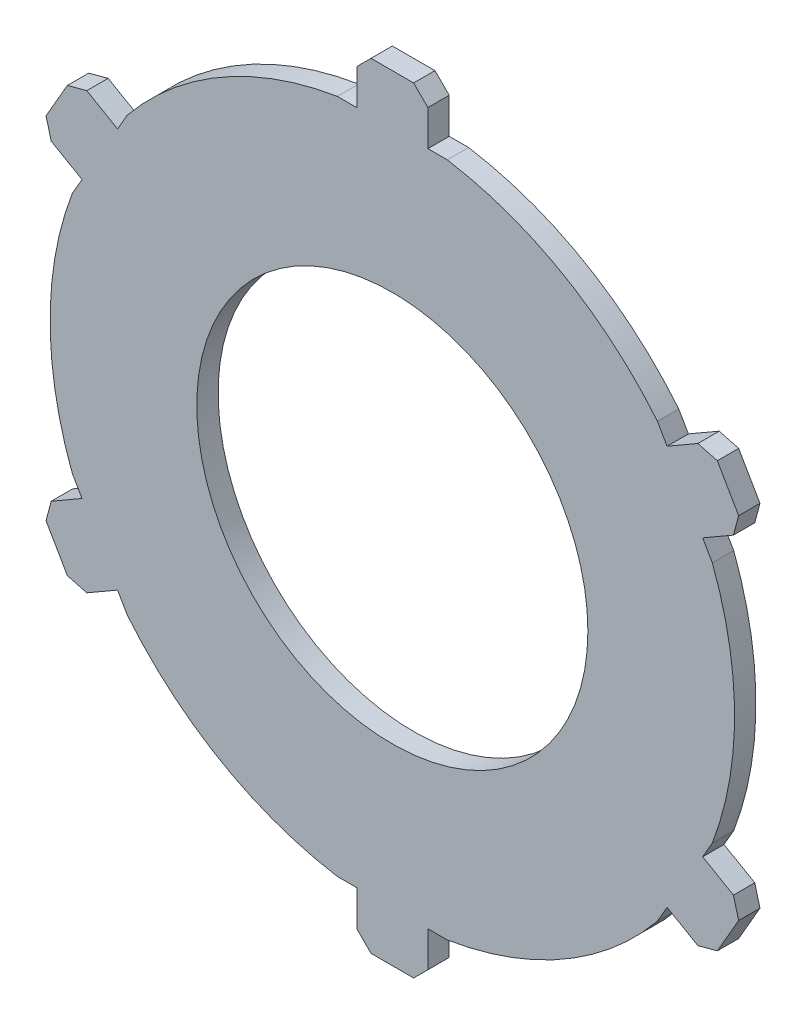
ISO-10303-21;
HEADER;
FILE_DESCRIPTION(('STEP AP214'),'2;1');
FILE_NAME('part.step','',(''),(''),'','','');
FILE_SCHEMA(('AUTOMOTIVE_DESIGN { 1 0 10303 214 1 1 1 1 }'));
ENDSEC;
DATA;
#1=APPLICATION_CONTEXT('core data for automotive mechanical design processes');
#2=APPLICATION_PROTOCOL_DEFINITION('international standard','automotive_design',2000,#1);
#3=PRODUCT_CONTEXT('',#1,'mechanical');
#4=PRODUCT('Part','Part','',(#3));
#5=PRODUCT_RELATED_PRODUCT_CATEGORY('part','',(#4));
#6=PRODUCT_DEFINITION_FORMATION('','',#4);
#7=PRODUCT_DEFINITION_CONTEXT('part definition',#1,'design');
#8=PRODUCT_DEFINITION('design','',#6,#7);
#9=PRODUCT_DEFINITION_SHAPE('','',#8);
#10=(LENGTH_UNIT() NAMED_UNIT(*) SI_UNIT(.MILLI.,.METRE.));
#11=(NAMED_UNIT(*) PLANE_ANGLE_UNIT() SI_UNIT($,.RADIAN.));
#12=(NAMED_UNIT(*) SI_UNIT($,.STERADIAN.) SOLID_ANGLE_UNIT());
#13=UNCERTAINTY_MEASURE_WITH_UNIT(LENGTH_MEASURE(1.E-05),#10,'distance_accuracy_value','');
#14=(GEOMETRIC_REPRESENTATION_CONTEXT(3) GLOBAL_UNCERTAINTY_ASSIGNED_CONTEXT((#13)) GLOBAL_UNIT_ASSIGNED_CONTEXT((#10,
#11,#12)) REPRESENTATION_CONTEXT('',''));
#15=CARTESIAN_POINT('',(0.,0.,0.));
#16=DIRECTION('',(0.,0.,1.));
#17=DIRECTION('',(1.,0.,0.));
#18=AXIS2_PLACEMENT_3D('',#15,#16,#17);
#19=CARTESIAN_POINT('',(0.,0.,12.));
#20=DIRECTION('',(0.,0.,1.));
#21=DIRECTION('',(1.,0.,0.));
#22=AXIS2_PLACEMENT_3D('',#19,#20,#21);
#23=PLANE('',#22);
#24=DIRECTION('',(0.500000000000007,0.866025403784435,0.));
#25=VECTOR('',#24,1.);
#26=CARTESIAN_POINT('',(-154.544826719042,112.32050807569,12.));
#27=LINE('',#26,#25);
#28=CARTESIAN_POINT('',(-154.544826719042,112.32050807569,12.));
#29=VERTEX_POINT('',#28);
#30=CARTESIAN_POINT('',(-149.083180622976,121.780356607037,12.));
#31=VERTEX_POINT('',#30);
#32=EDGE_CURVE('E46',#29,#31,#27,.T.);
#33=ORIENTED_EDGE('',*,*,#32,.F.);
#34=DIRECTION('',(-0.866025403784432,0.50000000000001,0.));
#35=VECTOR('',#34,1.);
#36=CARTESIAN_POINT('',(-171.865334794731,122.320508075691,12.));
#37=LINE('',#36,#35);
#38=CARTESIAN_POINT('',(-171.865334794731,122.320508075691,12.));
#39=VERTEX_POINT('',#38);
#40=EDGE_CURVE('E337',#29,#39,#37,.T.);
#41=ORIENTED_EDGE('',*,*,#40,.T.);
#42=DIRECTION('',(-0.965925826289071,-0.25881904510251,0.));
#43=VECTOR('',#42,1.);
#44=CARTESIAN_POINT('',(-182.793538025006,119.392304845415,12.));
#45=LINE('',#44,#43);
#46=CARTESIAN_POINT('',(-182.793538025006,119.392304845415,12.));
#47=VERTEX_POINT('',#46);
#48=EDGE_CURVE('E345',#39,#47,#45,.T.);
#49=ORIENTED_EDGE('',*,*,#48,.T.);
#50=DIRECTION('',(-0.50000000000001,-0.866025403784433,0.));
#51=VECTOR('',#50,1.);
#52=CARTESIAN_POINT('',(-194.793538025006,98.607695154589,12.));
#53=LINE('',#52,#51);
#54=CARTESIAN_POINT('',(-194.793538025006,98.607695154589,12.));
#55=VERTEX_POINT('',#54);
#56=EDGE_CURVE('E549',#47,#55,#53,.T.);
#57=ORIENTED_EDGE('',*,*,#56,.T.);
#58=DIRECTION('',(0.258819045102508,-0.965925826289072,0.));
#59=VECTOR('',#58,1.);
#60=CARTESIAN_POINT('',(-191.865334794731,87.6794919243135,12.));
#61=LINE('',#60,#59);
#62=CARTESIAN_POINT('',(-191.865334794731,87.6794919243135,12.));
#63=VERTEX_POINT('',#62);
#64=EDGE_CURVE('E551',#55,#63,#61,.T.);
#65=ORIENTED_EDGE('',*,*,#64,.T.);
#66=DIRECTION('',(0.866025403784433,-0.50000000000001,0.));
#67=VECTOR('',#66,1.);
#68=CARTESIAN_POINT('',(-191.865334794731,87.6794919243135,12.));
#69=LINE('',#68,#67);
#70=CARTESIAN_POINT('',(-174.544826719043,77.6794919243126,12.));
#71=VERTEX_POINT('',#70);
#72=EDGE_CURVE('E553',#63,#71,#69,.T.);
#73=ORIENTED_EDGE('',*,*,#72,.T.);
#74=DIRECTION('',(0.500000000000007,0.866025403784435,0.));
#75=VECTOR('',#74,1.);
#76=CARTESIAN_POINT('',(-174.544826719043,77.6794919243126,12.));
#77=LINE('',#76,#75);
#78=CARTESIAN_POINT('',(-180.006472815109,68.2196433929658,12.));
#79=VERTEX_POINT('',#78);
#80=EDGE_CURVE('E351',#79,#71,#77,.T.);
#81=ORIENTED_EDGE('',*,*,#80,.F.);
#82=CARTESIAN_POINT('',(0.,0.,12.));
#83=DIRECTION('',(0.,0.,1.));
#84=DIRECTION('',(1.,0.,0.));
#85=AXIS2_PLACEMENT_3D('',#82,#83,#84);
#86=CIRCLE('',#85,192.5);
#87=CARTESIAN_POINT('',(-180.00647281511,-68.2196433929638,12.));
#88=VERTEX_POINT('',#87);
#89=EDGE_CURVE('E555',#79,#88,#86,.T.);
#90=ORIENTED_EDGE('',*,*,#89,.T.);
#91=DIRECTION('',(-0.499999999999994,0.866025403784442,0.));
#92=VECTOR('',#91,1.);
#93=CARTESIAN_POINT('',(-174.544826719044,-77.6794919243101,12.));
#94=LINE('',#93,#92);
#95=CARTESIAN_POINT('',(-174.544826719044,-77.6794919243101,12.));
#96=VERTEX_POINT('',#95);
#97=EDGE_CURVE('E366',#96,#88,#94,.T.);
#98=ORIENTED_EDGE('',*,*,#97,.F.);
#99=DIRECTION('',(-0.866025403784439,-0.499999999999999,0.));
#100=VECTOR('',#99,1.);
#101=CARTESIAN_POINT('',(-191.865334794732,-87.6794919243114,12.));
#102=LINE('',#101,#100);
#103=CARTESIAN_POINT('',(-191.865334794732,-87.6794919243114,12.));
#104=VERTEX_POINT('',#103);
#105=EDGE_CURVE('E557',#96,#104,#102,.T.);
#106=ORIENTED_EDGE('',*,*,#105,.T.);
#107=DIRECTION('',(-0.258819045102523,-0.965925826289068,0.));
#108=VECTOR('',#107,1.);
#109=CARTESIAN_POINT('',(-194.793538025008,-98.6076951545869,12.));
#110=LINE('',#109,#108);
#111=CARTESIAN_POINT('',(-194.793538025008,-98.6076951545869,12.));
#112=VERTEX_POINT('',#111);
#113=EDGE_CURVE('E559',#104,#112,#110,.T.);
#114=ORIENTED_EDGE('',*,*,#113,.T.);
#115=DIRECTION('',(0.500000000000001,-0.866025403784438,0.));
#116=VECTOR('',#115,1.);
#117=CARTESIAN_POINT('',(-182.793538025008,-119.392304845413,12.));
#118=LINE('',#117,#116);
#119=CARTESIAN_POINT('',(-182.793538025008,-119.392304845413,12.));
#120=VERTEX_POINT('',#119);
#121=EDGE_CURVE('E561',#112,#120,#118,.T.);
#122=ORIENTED_EDGE('',*,*,#121,.T.);
#123=DIRECTION('',(0.965925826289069,-0.25881904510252,0.));
#124=VECTOR('',#123,1.);
#125=CARTESIAN_POINT('',(-171.865334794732,-122.320508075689,12.));
#126=LINE('',#125,#124);
#127=CARTESIAN_POINT('',(-171.865334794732,-122.320508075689,12.));
#128=VERTEX_POINT('',#127);
#129=EDGE_CURVE('E563',#120,#128,#126,.T.);
#130=ORIENTED_EDGE('',*,*,#129,.T.);
#131=DIRECTION('',(0.866025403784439,0.499999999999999,0.));
#132=VECTOR('',#131,1.);
#133=CARTESIAN_POINT('',(-171.865334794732,-122.320508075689,12.));
#134=LINE('',#133,#132);
#135=CARTESIAN_POINT('',(-154.544826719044,-112.320508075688,12.));
#136=VERTEX_POINT('',#135);
#137=EDGE_CURVE('E565',#128,#136,#134,.T.);
#138=ORIENTED_EDGE('',*,*,#137,.T.);
#139=DIRECTION('',(-0.499999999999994,0.866025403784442,0.));
#140=VECTOR('',#139,1.);
#141=CARTESIAN_POINT('',(-154.544826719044,-112.320508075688,12.));
#142=LINE('',#141,#140);
#143=CARTESIAN_POINT('',(-149.083180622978,-121.780356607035,12.));
#144=VERTEX_POINT('',#143);
#145=EDGE_CURVE('E375',#144,#136,#142,.T.);
#146=ORIENTED_EDGE('',*,*,#145,.F.);
#147=CARTESIAN_POINT('',(0.,0.,12.));
#148=DIRECTION('',(0.,0.,1.));
#149=DIRECTION('',(1.,0.,0.));
#150=AXIS2_PLACEMENT_3D('',#147,#148,#149);
#151=CIRCLE('',#150,192.5);
#152=CARTESIAN_POINT('',(-30.9232921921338,-190.,12.));
#153=VERTEX_POINT('',#152);
#154=EDGE_CURVE('E567',#144,#153,#151,.T.);
#155=ORIENTED_EDGE('',*,*,#154,.T.);
#156=DIRECTION('',(-1.,0.,0.));
#157=VECTOR('',#156,1.);
#158=CARTESIAN_POINT('',(-20.000000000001,-190.,12.));
#159=LINE('',#158,#157);
#160=CARTESIAN_POINT('',(-20.000000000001,-190.,12.));
#161=VERTEX_POINT('',#160);
#162=EDGE_CURVE('E384',#161,#153,#159,.T.);
#163=ORIENTED_EDGE('',*,*,#162,.F.);
#164=DIRECTION('',(0.,-1.,0.));
#165=VECTOR('',#164,1.);
#166=CARTESIAN_POINT('',(-19.9999999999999,-210.,12.));
#167=LINE('',#166,#165);
#168=CARTESIAN_POINT('',(-19.9999999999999,-210.,12.));
#169=VERTEX_POINT('',#168);
#170=EDGE_CURVE('E569',#161,#169,#167,.T.);
#171=ORIENTED_EDGE('',*,*,#170,.T.);
#172=DIRECTION('',(0.707106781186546,-0.707106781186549,0.));
#173=VECTOR('',#172,1.);
#174=CARTESIAN_POINT('',(-11.9999999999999,-218.,12.));
#175=LINE('',#174,#173);
#176=CARTESIAN_POINT('',(-11.9999999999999,-218.,12.));
#177=VERTEX_POINT('',#176);
#178=EDGE_CURVE('E571',#169,#177,#175,.T.);
#179=ORIENTED_EDGE('',*,*,#178,.T.);
#180=DIRECTION('',(1.,0.,0.));
#181=VECTOR('',#180,1.);
#182=CARTESIAN_POINT('',(12.0000000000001,-218.,12.));
#183=LINE('',#182,#181);
#184=CARTESIAN_POINT('',(12.0000000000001,-218.,12.));
#185=VERTEX_POINT('',#184);
#186=EDGE_CURVE('E573',#177,#185,#183,.T.);
#187=ORIENTED_EDGE('',*,*,#186,.T.);
#188=DIRECTION('',(0.707106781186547,0.707106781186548,0.));
#189=VECTOR('',#188,1.);
#190=CARTESIAN_POINT('',(20.0000000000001,-210.,12.));
#191=LINE('',#190,#189);
#192=CARTESIAN_POINT('',(20.0000000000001,-210.,12.));
#193=VERTEX_POINT('',#192);
#194=EDGE_CURVE('E575',#185,#193,#191,.T.);
#195=ORIENTED_EDGE('',*,*,#194,.T.);
#196=DIRECTION('',(0.,1.,0.));
#197=VECTOR('',#196,1.);
#198=CARTESIAN_POINT('',(20.0000000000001,-210.,12.));
#199=LINE('',#198,#197);
#200=CARTESIAN_POINT('',(19.999999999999,-190.,12.));
#201=VERTEX_POINT('',#200);
#202=EDGE_CURVE('E577',#193,#201,#199,.T.);
#203=ORIENTED_EDGE('',*,*,#202,.T.);
#204=DIRECTION('',(-1.,0.,0.));
#205=VECTOR('',#204,1.);
#206=CARTESIAN_POINT('',(19.999999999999,-190.,12.));
#207=LINE('',#206,#205);
#208=CARTESIAN_POINT('',(30.9232921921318,-190.,12.));
#209=VERTEX_POINT('',#208);
#210=EDGE_CURVE('E393',#209,#201,#207,.T.);
#211=ORIENTED_EDGE('',*,*,#210,.F.);
#212=CARTESIAN_POINT('',(0.,0.,12.));
#213=DIRECTION('',(0.,0.,1.));
#214=DIRECTION('',(1.,0.,0.));
#215=AXIS2_PLACEMENT_3D('',#212,#213,#214);
#216=CIRCLE('',#215,192.5);
#217=CARTESIAN_POINT('',(149.083180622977,-121.780356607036,12.));
#218=VERTEX_POINT('',#217);
#219=EDGE_CURVE('E579',#209,#218,#216,.T.);
#220=ORIENTED_EDGE('',*,*,#219,.T.);
#221=DIRECTION('',(-0.500000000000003,-0.866025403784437,0.));
#222=VECTOR('',#221,1.);
#223=CARTESIAN_POINT('',(154.544826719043,-112.320508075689,12.));
#224=LINE('',#223,#222);
#225=CARTESIAN_POINT('',(154.544826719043,-112.320508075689,12.));
#226=VERTEX_POINT('',#225);
#227=EDGE_CURVE('E402',#226,#218,#224,.T.);
#228=ORIENTED_EDGE('',*,*,#227,.F.);
#229=DIRECTION('',(0.866025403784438,-0.500000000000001,0.));
#230=VECTOR('',#229,1.);
#231=CARTESIAN_POINT('',(171.865334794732,-122.320508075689,12.));
#232=LINE('',#231,#230);
#233=CARTESIAN_POINT('',(171.865334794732,-122.320508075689,12.));
#234=VERTEX_POINT('',#233);
#235=EDGE_CURVE('E581',#226,#234,#232,.T.);
#236=ORIENTED_EDGE('',*,*,#235,.T.);
#237=DIRECTION('',(0.965925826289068,0.258819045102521,0.));
#238=VECTOR('',#237,1.);
#239=CARTESIAN_POINT('',(182.793538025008,-119.392304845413,12.));
#240=LINE('',#239,#238);
#241=CARTESIAN_POINT('',(182.793538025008,-119.392304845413,12.));
#242=VERTEX_POINT('',#241);
#243=EDGE_CURVE('E583',#234,#242,#240,.T.);
#244=ORIENTED_EDGE('',*,*,#243,.T.);
#245=DIRECTION('',(0.499999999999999,0.866025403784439,0.));
#246=VECTOR('',#245,1.);
#247=CARTESIAN_POINT('',(194.793538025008,-98.6076951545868,12.));
#248=LINE('',#247,#246);
#249=CARTESIAN_POINT('',(194.793538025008,-98.6076951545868,12.));
#250=VERTEX_POINT('',#249);
#251=EDGE_CURVE('E585',#242,#250,#248,.T.);
#252=ORIENTED_EDGE('',*,*,#251,.T.);
#253=DIRECTION('',(-0.258819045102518,0.965925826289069,0.));
#254=VECTOR('',#253,1.);
#255=CARTESIAN_POINT('',(191.865334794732,-87.6794919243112,12.));
#256=LINE('',#255,#254);
#257=CARTESIAN_POINT('',(191.865334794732,-87.6794919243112,12.));
#258=VERTEX_POINT('',#257);
#259=EDGE_CURVE('E587',#250,#258,#256,.T.);
#260=ORIENTED_EDGE('',*,*,#259,.T.);
#261=DIRECTION('',(-0.866025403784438,0.500000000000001,0.));
#262=VECTOR('',#261,1.);
#263=CARTESIAN_POINT('',(191.865334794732,-87.6794919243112,12.));
#264=LINE('',#263,#262);
#265=CARTESIAN_POINT('',(174.544826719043,-77.6794919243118,12.));
#266=VERTEX_POINT('',#265);
#267=EDGE_CURVE('E589',#258,#266,#264,.T.);
#268=ORIENTED_EDGE('',*,*,#267,.T.);
#269=DIRECTION('',(-0.500000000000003,-0.866025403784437,0.));
#270=VECTOR('',#269,1.);
#271=CARTESIAN_POINT('',(174.544826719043,-77.6794919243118,12.));
#272=LINE('',#271,#270);
#273=CARTESIAN_POINT('',(180.006472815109,-68.2196433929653,12.));
#274=VERTEX_POINT('',#273);
#275=EDGE_CURVE('E411',#274,#266,#272,.T.);
#276=ORIENTED_EDGE('',*,*,#275,.F.);
#277=CARTESIAN_POINT('',(0.,0.,12.));
#278=DIRECTION('',(0.,0.,1.));
#279=DIRECTION('',(1.,0.,0.));
#280=AXIS2_PLACEMENT_3D('',#277,#278,#279);
#281=CIRCLE('',#280,192.5);
#282=CARTESIAN_POINT('',(180.00647281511,68.219643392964,12.));
#283=VERTEX_POINT('',#282);
#284=EDGE_CURVE('E591',#274,#283,#281,.T.);
#285=ORIENTED_EDGE('',*,*,#284,.T.);
#286=DIRECTION('',(0.499999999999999,-0.866025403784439,0.));
#287=VECTOR('',#286,1.);
#288=CARTESIAN_POINT('',(174.544826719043,77.6794919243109,12.));
#289=LINE('',#288,#287);
#290=CARTESIAN_POINT('',(174.544826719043,77.6794919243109,12.));
#291=VERTEX_POINT('',#290);
#292=EDGE_CURVE('E420',#291,#283,#289,.T.);
#293=ORIENTED_EDGE('',*,*,#292,.F.);
#294=DIRECTION('',(0.866025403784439,0.499999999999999,0.));
#295=VECTOR('',#294,1.);
#296=CARTESIAN_POINT('',(191.865334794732,87.6794919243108,12.));
#297=LINE('',#296,#295);
#298=CARTESIAN_POINT('',(191.865334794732,87.6794919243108,12.));
#299=VERTEX_POINT('',#298);
#300=EDGE_CURVE('E593',#291,#299,#297,.T.);
#301=ORIENTED_EDGE('',*,*,#300,.T.);
#302=DIRECTION('',(0.258819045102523,0.965925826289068,0.));
#303=VECTOR('',#302,1.);
#304=CARTESIAN_POINT('',(194.793538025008,98.6076951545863,12.));
#305=LINE('',#304,#303);
#306=CARTESIAN_POINT('',(194.793538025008,98.6076951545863,12.));
#307=VERTEX_POINT('',#306);
#308=EDGE_CURVE('E595',#299,#307,#305,.T.);
#309=ORIENTED_EDGE('',*,*,#308,.T.);
#310=DIRECTION('',(-0.499999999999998,0.86602540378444,0.));
#311=VECTOR('',#310,1.);
#312=CARTESIAN_POINT('',(182.793538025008,119.392304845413,12.));
#313=LINE('',#312,#311);
#314=CARTESIAN_POINT('',(182.793538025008,119.392304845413,12.));
#315=VERTEX_POINT('',#314);
#316=EDGE_CURVE('E597',#307,#315,#313,.T.);
#317=ORIENTED_EDGE('',*,*,#316,.T.);
#318=DIRECTION('',(-0.965925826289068,0.258819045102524,0.));
#319=VECTOR('',#318,1.);
#320=CARTESIAN_POINT('',(171.865334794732,122.320508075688,12.));
#321=LINE('',#320,#319);
#322=CARTESIAN_POINT('',(171.865334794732,122.320508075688,12.));
#323=VERTEX_POINT('',#322);
#324=EDGE_CURVE('E599',#315,#323,#321,.T.);
#325=ORIENTED_EDGE('',*,*,#324,.T.);
#326=DIRECTION('',(-0.86602540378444,-0.499999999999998,0.));
#327=VECTOR('',#326,1.);
#328=CARTESIAN_POINT('',(171.865334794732,122.320508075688,12.));
#329=LINE('',#328,#327);
#330=CARTESIAN_POINT('',(154.544826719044,112.320508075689,12.));
#331=VERTEX_POINT('',#330);
#332=EDGE_CURVE('E601',#323,#331,#329,.T.);
#333=ORIENTED_EDGE('',*,*,#332,.T.);
#334=DIRECTION('',(0.499999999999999,-0.866025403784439,0.));
#335=VECTOR('',#334,1.);
#336=CARTESIAN_POINT('',(154.544826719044,112.320508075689,12.));
#337=LINE('',#336,#335);
#338=CARTESIAN_POINT('',(149.083180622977,121.780356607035,12.));
#339=VERTEX_POINT('',#338);
#340=EDGE_CURVE('E429',#339,#331,#337,.T.);
#341=ORIENTED_EDGE('',*,*,#340,.F.);
#342=CARTESIAN_POINT('',(0.,0.,12.));
#343=DIRECTION('',(0.,0.,1.));
#344=DIRECTION('',(1.,0.,0.));
#345=AXIS2_PLACEMENT_3D('',#342,#343,#344);
#346=CIRCLE('',#345,192.5);
#347=CARTESIAN_POINT('',(30.9232921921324,190.,12.));
#348=VERTEX_POINT('',#347);
#349=EDGE_CURVE('E535',#339,#348,#346,.T.);
#350=ORIENTED_EDGE('',*,*,#349,.T.);
#351=DIRECTION('',(1.,0.,0.));
#352=VECTOR('',#351,1.);
#353=CARTESIAN_POINT('',(20.,190.,12.));
#354=LINE('',#353,#352);
#355=CARTESIAN_POINT('',(20.,190.,12.));
#356=VERTEX_POINT('',#355);
#357=EDGE_CURVE('E438',#356,#348,#354,.T.);
#358=ORIENTED_EDGE('',*,*,#357,.F.);
#359=DIRECTION('',(0.,1.,0.));
#360=VECTOR('',#359,1.);
#361=CARTESIAN_POINT('',(20.,210.,12.));
#362=LINE('',#361,#360);
#363=CARTESIAN_POINT('',(20.,210.,12.));
#364=VERTEX_POINT('',#363);
#365=EDGE_CURVE('E537',#356,#364,#362,.T.);
#366=ORIENTED_EDGE('',*,*,#365,.T.);
#367=DIRECTION('',(-0.707106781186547,0.707106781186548,0.));
#368=VECTOR('',#367,1.);
#369=CARTESIAN_POINT('',(12.,218.,12.));
#370=LINE('',#369,#368);
#371=CARTESIAN_POINT('',(12.,218.,12.));
#372=VERTEX_POINT('',#371);
#373=EDGE_CURVE('E539',#364,#372,#370,.T.);
#374=ORIENTED_EDGE('',*,*,#373,.T.);
#375=DIRECTION('',(-1.,0.,0.));
#376=VECTOR('',#375,1.);
#377=CARTESIAN_POINT('',(-12.,218.,12.));
#378=LINE('',#377,#376);
#379=CARTESIAN_POINT('',(-12.,218.,12.));
#380=VERTEX_POINT('',#379);
#381=EDGE_CURVE('E541',#372,#380,#378,.T.);
#382=ORIENTED_EDGE('',*,*,#381,.T.);
#383=DIRECTION('',(-0.707106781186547,-0.707106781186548,0.));
#384=VECTOR('',#383,1.);
#385=CARTESIAN_POINT('',(-20.,210.,12.));
#386=LINE('',#385,#384);
#387=CARTESIAN_POINT('',(-20.,210.,12.));
#388=VERTEX_POINT('',#387);
#389=EDGE_CURVE('E543',#380,#388,#386,.T.);
#390=ORIENTED_EDGE('',*,*,#389,.T.);
#391=DIRECTION('',(0.,-1.,0.));
#392=VECTOR('',#391,1.);
#393=CARTESIAN_POINT('',(-20.,210.,12.));
#394=LINE('',#393,#392);
#395=CARTESIAN_POINT('',(-20.,190.,12.));
#396=VERTEX_POINT('',#395);
#397=EDGE_CURVE('E545',#388,#396,#394,.T.);
#398=ORIENTED_EDGE('',*,*,#397,.T.);
#399=DIRECTION('',(1.,0.,0.));
#400=VECTOR('',#399,1.);
#401=CARTESIAN_POINT('',(-20.,190.,12.));
#402=LINE('',#401,#400);
#403=CARTESIAN_POINT('',(-30.9232921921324,190.,12.));
#404=VERTEX_POINT('',#403);
#405=EDGE_CURVE('E447',#404,#396,#402,.T.);
#406=ORIENTED_EDGE('',*,*,#405,.F.);
#407=CARTESIAN_POINT('',(0.,0.,12.));
#408=DIRECTION('',(0.,0.,1.));
#409=DIRECTION('',(1.,0.,0.));
#410=AXIS2_PLACEMENT_3D('',#407,#408,#409);
#411=CIRCLE('',#410,192.5);
#412=EDGE_CURVE('E346',#404,#31,#411,.T.);
#413=ORIENTED_EDGE('',*,*,#412,.T.);
#414=EDGE_LOOP('',(#33,#41,#49,#57,#65,#73,#81,#90,#98,#106,#114,#122,#130,#138,#146,#155,#163,
#171,#179,#187,#195,#203,#211,#220,#228,#236,#244,#252,#260,#268,#276,#285,#293,#301,#309,#317,
#325,#333,#341,#350,#358,#366,#374,#382,#390,#398,#406,#413));
#415=FACE_BOUND('',#414,.T.);
#416=CARTESIAN_POINT('',(0.,0.,12.));
#417=DIRECTION('',(0.,0.,1.));
#418=DIRECTION('',(1.,0.,0.));
#419=AXIS2_PLACEMENT_3D('',#416,#417,#418);
#420=CIRCLE('',#419,110.);
#421=CARTESIAN_POINT('',(110.,0.,12.));
#422=VERTEX_POINT('',#421);
#423=EDGE_CURVE('E459',#422,#422,#420,.T.);
#424=ORIENTED_EDGE('',*,*,#423,.F.);
#425=EDGE_LOOP('',(#424));
#426=FACE_BOUND('',#425,.T.);
#427=ADVANCED_FACE('F31',(#415,#426),#23,.T.);
#428=CARTESIAN_POINT('',(0.,0.,0.));
#429=DIRECTION('',(0.,0.,1.));
#430=DIRECTION('',(1.,0.,0.));
#431=AXIS2_PLACEMENT_3D('',#428,#429,#430);
#432=PLANE('',#431);
#433=DIRECTION('',(-0.866025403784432,0.50000000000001,0.));
#434=VECTOR('',#433,1.);
#435=CARTESIAN_POINT('',(-171.865334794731,122.320508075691,0.));
#436=LINE('',#435,#434);
#437=CARTESIAN_POINT('',(-154.544826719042,112.32050807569,0.));
#438=VERTEX_POINT('',#437);
#439=CARTESIAN_POINT('',(-171.865334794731,122.320508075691,0.));
#440=VERTEX_POINT('',#439);
#441=EDGE_CURVE('E477',#438,#440,#436,.T.);
#442=ORIENTED_EDGE('',*,*,#441,.F.);
#443=DIRECTION('',(0.500000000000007,0.866025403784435,0.));
#444=VECTOR('',#443,1.);
#445=CARTESIAN_POINT('',(-154.544826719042,112.32050807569,0.));
#446=LINE('',#445,#444);
#447=CARTESIAN_POINT('',(-149.083180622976,121.780356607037,0.));
#448=VERTEX_POINT('',#447);
#449=EDGE_CURVE('E350',#438,#448,#446,.T.);
#450=ORIENTED_EDGE('',*,*,#449,.T.);
#451=CARTESIAN_POINT('',(0.,0.,0.));
#452=DIRECTION('',(0.,0.,1.));
#453=DIRECTION('',(1.,0.,0.));
#454=AXIS2_PLACEMENT_3D('',#451,#452,#453);
#455=CIRCLE('',#454,192.5);
#456=CARTESIAN_POINT('',(-30.9232921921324,190.,0.));
#457=VERTEX_POINT('',#456);
#458=EDGE_CURVE('E474',#457,#448,#455,.T.);
#459=ORIENTED_EDGE('',*,*,#458,.F.);
#460=DIRECTION('',(1.,0.,0.));
#461=VECTOR('',#460,1.);
#462=CARTESIAN_POINT('',(-20.,190.,0.));
#463=LINE('',#462,#461);
#464=CARTESIAN_POINT('',(-20.,190.,0.));
#465=VERTEX_POINT('',#464);
#466=EDGE_CURVE('E450',#457,#465,#463,.T.);
#467=ORIENTED_EDGE('',*,*,#466,.T.);
#468=DIRECTION('',(0.,-1.,0.));
#469=VECTOR('',#468,1.);
#470=CARTESIAN_POINT('',(-20.,210.,0.));
#471=LINE('',#470,#469);
#472=CARTESIAN_POINT('',(-20.,210.,0.));
#473=VERTEX_POINT('',#472);
#474=EDGE_CURVE('E472',#473,#465,#471,.T.);
#475=ORIENTED_EDGE('',*,*,#474,.F.);
#476=DIRECTION('',(-0.707106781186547,-0.707106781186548,0.));
#477=VECTOR('',#476,1.);
#478=CARTESIAN_POINT('',(-20.,210.,0.));
#479=LINE('',#478,#477);
#480=CARTESIAN_POINT('',(-12.,218.,0.));
#481=VERTEX_POINT('',#480);
#482=EDGE_CURVE('E470',#481,#473,#479,.T.);
#483=ORIENTED_EDGE('',*,*,#482,.F.);
#484=DIRECTION('',(-1.,0.,0.));
#485=VECTOR('',#484,1.);
#486=CARTESIAN_POINT('',(-12.,218.,0.));
#487=LINE('',#486,#485);
#488=CARTESIAN_POINT('',(12.,218.,0.));
#489=VERTEX_POINT('',#488);
#490=EDGE_CURVE('E468',#489,#481,#487,.T.);
#491=ORIENTED_EDGE('',*,*,#490,.F.);
#492=DIRECTION('',(-0.707106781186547,0.707106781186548,0.));
#493=VECTOR('',#492,1.);
#494=CARTESIAN_POINT('',(12.,218.,0.));
#495=LINE('',#494,#493);
#496=CARTESIAN_POINT('',(20.,210.,0.));
#497=VERTEX_POINT('',#496);
#498=EDGE_CURVE('E466',#497,#489,#495,.T.);
#499=ORIENTED_EDGE('',*,*,#498,.F.);
#500=DIRECTION('',(0.,1.,0.));
#501=VECTOR('',#500,1.);
#502=CARTESIAN_POINT('',(20.,210.,0.));
#503=LINE('',#502,#501);
#504=CARTESIAN_POINT('',(20.,190.,0.));
#505=VERTEX_POINT('',#504);
#506=EDGE_CURVE('E464',#505,#497,#503,.T.);
#507=ORIENTED_EDGE('',*,*,#506,.F.);
#508=DIRECTION('',(1.,0.,0.));
#509=VECTOR('',#508,1.);
#510=CARTESIAN_POINT('',(20.,190.,0.));
#511=LINE('',#510,#509);
#512=CARTESIAN_POINT('',(30.9232921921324,190.,0.));
#513=VERTEX_POINT('',#512);
#514=EDGE_CURVE('E441',#505,#513,#511,.T.);
#515=ORIENTED_EDGE('',*,*,#514,.T.);
#516=CARTESIAN_POINT('',(0.,0.,0.));
#517=DIRECTION('',(0.,0.,1.));
#518=DIRECTION('',(1.,0.,0.));
#519=AXIS2_PLACEMENT_3D('',#516,#517,#518);
#520=CIRCLE('',#519,192.5);
#521=CARTESIAN_POINT('',(149.083180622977,121.780356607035,0.));
#522=VERTEX_POINT('',#521);
#523=EDGE_CURVE('E462',#522,#513,#520,.T.);
#524=ORIENTED_EDGE('',*,*,#523,.F.);
#525=DIRECTION('',(0.499999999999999,-0.866025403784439,0.));
#526=VECTOR('',#525,1.);
#527=CARTESIAN_POINT('',(154.544826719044,112.320508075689,0.));
#528=LINE('',#527,#526);
#529=CARTESIAN_POINT('',(154.544826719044,112.320508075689,0.));
#530=VERTEX_POINT('',#529);
#531=EDGE_CURVE('E432',#522,#530,#528,.T.);
#532=ORIENTED_EDGE('',*,*,#531,.T.);
#533=DIRECTION('',(-0.86602540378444,-0.499999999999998,0.));
#534=VECTOR('',#533,1.);
#535=CARTESIAN_POINT('',(171.865334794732,122.320508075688,0.));
#536=LINE('',#535,#534);
#537=CARTESIAN_POINT('',(171.865334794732,122.320508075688,0.));
#538=VERTEX_POINT('',#537);
#539=EDGE_CURVE('E533',#538,#530,#536,.T.);
#540=ORIENTED_EDGE('',*,*,#539,.F.);
#541=DIRECTION('',(-0.965925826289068,0.258819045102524,0.));
#542=VECTOR('',#541,1.);
#543=CARTESIAN_POINT('',(171.865334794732,122.320508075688,0.));
#544=LINE('',#543,#542);
#545=CARTESIAN_POINT('',(182.793538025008,119.392304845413,0.));
#546=VERTEX_POINT('',#545);
#547=EDGE_CURVE('E531',#546,#538,#544,.T.);
#548=ORIENTED_EDGE('',*,*,#547,.F.);
#549=DIRECTION('',(-0.499999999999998,0.86602540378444,0.));
#550=VECTOR('',#549,1.);
#551=CARTESIAN_POINT('',(182.793538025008,119.392304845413,0.));
#552=LINE('',#551,#550);
#553=CARTESIAN_POINT('',(194.793538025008,98.6076951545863,0.));
#554=VERTEX_POINT('',#553);
#555=EDGE_CURVE('E529',#554,#546,#552,.T.);
#556=ORIENTED_EDGE('',*,*,#555,.F.);
#557=DIRECTION('',(0.258819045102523,0.965925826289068,0.));
#558=VECTOR('',#557,1.);
#559=CARTESIAN_POINT('',(194.793538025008,98.6076951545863,0.));
#560=LINE('',#559,#558);
#561=CARTESIAN_POINT('',(191.865334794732,87.6794919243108,0.));
#562=VERTEX_POINT('',#561);
#563=EDGE_CURVE('E527',#562,#554,#560,.T.);
#564=ORIENTED_EDGE('',*,*,#563,.F.);
#565=DIRECTION('',(0.866025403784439,0.499999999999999,0.));
#566=VECTOR('',#565,1.);
#567=CARTESIAN_POINT('',(191.865334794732,87.6794919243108,0.));
#568=LINE('',#567,#566);
#569=CARTESIAN_POINT('',(174.544826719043,77.6794919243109,0.));
#570=VERTEX_POINT('',#569);
#571=EDGE_CURVE('E525',#570,#562,#568,.T.);
#572=ORIENTED_EDGE('',*,*,#571,.F.);
#573=DIRECTION('',(0.499999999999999,-0.866025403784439,0.));
#574=VECTOR('',#573,1.);
#575=CARTESIAN_POINT('',(174.544826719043,77.6794919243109,0.));
#576=LINE('',#575,#574);
#577=CARTESIAN_POINT('',(180.00647281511,68.219643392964,0.));
#578=VERTEX_POINT('',#577);
#579=EDGE_CURVE('E423',#570,#578,#576,.T.);
#580=ORIENTED_EDGE('',*,*,#579,.T.);
#581=CARTESIAN_POINT('',(0.,0.,0.));
#582=DIRECTION('',(0.,0.,1.));
#583=DIRECTION('',(1.,0.,0.));
#584=AXIS2_PLACEMENT_3D('',#581,#582,#583);
#585=CIRCLE('',#584,192.5);
#586=CARTESIAN_POINT('',(180.006472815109,-68.2196433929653,0.));
#587=VERTEX_POINT('',#586);
#588=EDGE_CURVE('E523',#587,#578,#585,.T.);
#589=ORIENTED_EDGE('',*,*,#588,.F.);
#590=DIRECTION('',(-0.500000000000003,-0.866025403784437,0.));
#591=VECTOR('',#590,1.);
#592=CARTESIAN_POINT('',(174.544826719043,-77.6794919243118,0.));
#593=LINE('',#592,#591);
#594=CARTESIAN_POINT('',(174.544826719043,-77.6794919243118,0.));
#595=VERTEX_POINT('',#594);
#596=EDGE_CURVE('E414',#587,#595,#593,.T.);
#597=ORIENTED_EDGE('',*,*,#596,.T.);
#598=DIRECTION('',(-0.866025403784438,0.500000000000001,0.));
#599=VECTOR('',#598,1.);
#600=CARTESIAN_POINT('',(191.865334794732,-87.6794919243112,0.));
#601=LINE('',#600,#599);
#602=CARTESIAN_POINT('',(191.865334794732,-87.6794919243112,0.));
#603=VERTEX_POINT('',#602);
#604=EDGE_CURVE('E521',#603,#595,#601,.T.);
#605=ORIENTED_EDGE('',*,*,#604,.F.);
#606=DIRECTION('',(-0.258819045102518,0.965925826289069,0.));
#607=VECTOR('',#606,1.);
#608=CARTESIAN_POINT('',(191.865334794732,-87.6794919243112,0.));
#609=LINE('',#608,#607);
#610=CARTESIAN_POINT('',(194.793538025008,-98.6076951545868,0.));
#611=VERTEX_POINT('',#610);
#612=EDGE_CURVE('E519',#611,#603,#609,.T.);
#613=ORIENTED_EDGE('',*,*,#612,.F.);
#614=DIRECTION('',(0.499999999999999,0.866025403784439,0.));
#615=VECTOR('',#614,1.);
#616=CARTESIAN_POINT('',(194.793538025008,-98.6076951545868,0.));
#617=LINE('',#616,#615);
#618=CARTESIAN_POINT('',(182.793538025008,-119.392304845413,0.));
#619=VERTEX_POINT('',#618);
#620=EDGE_CURVE('E517',#619,#611,#617,.T.);
#621=ORIENTED_EDGE('',*,*,#620,.F.);
#622=DIRECTION('',(0.965925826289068,0.258819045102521,0.));
#623=VECTOR('',#622,1.);
#624=CARTESIAN_POINT('',(182.793538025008,-119.392304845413,0.));
#625=LINE('',#624,#623);
#626=CARTESIAN_POINT('',(171.865334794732,-122.320508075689,0.));
#627=VERTEX_POINT('',#626);
#628=EDGE_CURVE('E515',#627,#619,#625,.T.);
#629=ORIENTED_EDGE('',*,*,#628,.F.);
#630=DIRECTION('',(0.866025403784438,-0.500000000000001,0.));
#631=VECTOR('',#630,1.);
#632=CARTESIAN_POINT('',(171.865334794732,-122.320508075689,0.));
#633=LINE('',#632,#631);
#634=CARTESIAN_POINT('',(154.544826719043,-112.320508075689,0.));
#635=VERTEX_POINT('',#634);
#636=EDGE_CURVE('E513',#635,#627,#633,.T.);
#637=ORIENTED_EDGE('',*,*,#636,.F.);
#638=DIRECTION('',(-0.500000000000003,-0.866025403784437,0.));
#639=VECTOR('',#638,1.);
#640=CARTESIAN_POINT('',(154.544826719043,-112.320508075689,0.));
#641=LINE('',#640,#639);
#642=CARTESIAN_POINT('',(149.083180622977,-121.780356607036,0.));
#643=VERTEX_POINT('',#642);
#644=EDGE_CURVE('E405',#635,#643,#641,.T.);
#645=ORIENTED_EDGE('',*,*,#644,.T.);
#646=CARTESIAN_POINT('',(0.,0.,0.));
#647=DIRECTION('',(0.,0.,1.));
#648=DIRECTION('',(1.,0.,0.));
#649=AXIS2_PLACEMENT_3D('',#646,#647,#648);
#650=CIRCLE('',#649,192.5);
#651=CARTESIAN_POINT('',(30.9232921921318,-190.,0.));
#652=VERTEX_POINT('',#651);
#653=EDGE_CURVE('E511',#652,#643,#650,.T.);
#654=ORIENTED_EDGE('',*,*,#653,.F.);
#655=DIRECTION('',(-1.,0.,0.));
#656=VECTOR('',#655,1.);
#657=CARTESIAN_POINT('',(19.999999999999,-190.,0.));
#658=LINE('',#657,#656);
#659=CARTESIAN_POINT('',(19.999999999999,-190.,0.));
#660=VERTEX_POINT('',#659);
#661=EDGE_CURVE('E396',#652,#660,#658,.T.);
#662=ORIENTED_EDGE('',*,*,#661,.T.);
#663=DIRECTION('',(0.,1.,0.));
#664=VECTOR('',#663,1.);
#665=CARTESIAN_POINT('',(20.0000000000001,-210.,0.));
#666=LINE('',#665,#664);
#667=CARTESIAN_POINT('',(20.0000000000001,-210.,0.));
#668=VERTEX_POINT('',#667);
#669=EDGE_CURVE('E509',#668,#660,#666,.T.);
#670=ORIENTED_EDGE('',*,*,#669,.F.);
#671=DIRECTION('',(0.707106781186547,0.707106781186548,0.));
#672=VECTOR('',#671,1.);
#673=CARTESIAN_POINT('',(20.0000000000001,-210.,0.));
#674=LINE('',#673,#672);
#675=CARTESIAN_POINT('',(12.0000000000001,-218.,0.));
#676=VERTEX_POINT('',#675);
#677=EDGE_CURVE('E507',#676,#668,#674,.T.);
#678=ORIENTED_EDGE('',*,*,#677,.F.);
#679=DIRECTION('',(1.,0.,0.));
#680=VECTOR('',#679,1.);
#681=CARTESIAN_POINT('',(12.0000000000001,-218.,0.));
#682=LINE('',#681,#680);
#683=CARTESIAN_POINT('',(-11.9999999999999,-218.,0.));
#684=VERTEX_POINT('',#683);
#685=EDGE_CURVE('E505',#684,#676,#682,.T.);
#686=ORIENTED_EDGE('',*,*,#685,.F.);
#687=DIRECTION('',(0.707106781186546,-0.707106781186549,0.));
#688=VECTOR('',#687,1.);
#689=CARTESIAN_POINT('',(-11.9999999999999,-218.,0.));
#690=LINE('',#689,#688);
#691=CARTESIAN_POINT('',(-19.9999999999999,-210.,0.));
#692=VERTEX_POINT('',#691);
#693=EDGE_CURVE('E503',#692,#684,#690,.T.);
#694=ORIENTED_EDGE('',*,*,#693,.F.);
#695=DIRECTION('',(0.,-1.,0.));
#696=VECTOR('',#695,1.);
#697=CARTESIAN_POINT('',(-19.9999999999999,-210.,0.));
#698=LINE('',#697,#696);
#699=CARTESIAN_POINT('',(-20.000000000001,-190.,0.));
#700=VERTEX_POINT('',#699);
#701=EDGE_CURVE('E501',#700,#692,#698,.T.);
#702=ORIENTED_EDGE('',*,*,#701,.F.);
#703=DIRECTION('',(-1.,0.,0.));
#704=VECTOR('',#703,1.);
#705=CARTESIAN_POINT('',(-20.000000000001,-190.,0.));
#706=LINE('',#705,#704);
#707=CARTESIAN_POINT('',(-30.9232921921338,-190.,0.));
#708=VERTEX_POINT('',#707);
#709=EDGE_CURVE('E387',#700,#708,#706,.T.);
#710=ORIENTED_EDGE('',*,*,#709,.T.);
#711=CARTESIAN_POINT('',(0.,0.,0.));
#712=DIRECTION('',(0.,0.,1.));
#713=DIRECTION('',(1.,0.,0.));
#714=AXIS2_PLACEMENT_3D('',#711,#712,#713);
#715=CIRCLE('',#714,192.5);
#716=CARTESIAN_POINT('',(-149.083180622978,-121.780356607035,0.));
#717=VERTEX_POINT('',#716);
#718=EDGE_CURVE('E499',#717,#708,#715,.T.);
#719=ORIENTED_EDGE('',*,*,#718,.F.);
#720=DIRECTION('',(-0.499999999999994,0.866025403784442,0.));
#721=VECTOR('',#720,1.);
#722=CARTESIAN_POINT('',(-154.544826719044,-112.320508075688,0.));
#723=LINE('',#722,#721);
#724=CARTESIAN_POINT('',(-154.544826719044,-112.320508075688,0.));
#725=VERTEX_POINT('',#724);
#726=EDGE_CURVE('E378',#717,#725,#723,.T.);
#727=ORIENTED_EDGE('',*,*,#726,.T.);
#728=DIRECTION('',(0.866025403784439,0.499999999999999,0.));
#729=VECTOR('',#728,1.);
#730=CARTESIAN_POINT('',(-171.865334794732,-122.320508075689,0.));
#731=LINE('',#730,#729);
#732=CARTESIAN_POINT('',(-171.865334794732,-122.320508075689,0.));
#733=VERTEX_POINT('',#732);
#734=EDGE_CURVE('E497',#733,#725,#731,.T.);
#735=ORIENTED_EDGE('',*,*,#734,.F.);
#736=DIRECTION('',(0.965925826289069,-0.25881904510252,0.));
#737=VECTOR('',#736,1.);
#738=CARTESIAN_POINT('',(-171.865334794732,-122.320508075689,0.));
#739=LINE('',#738,#737);
#740=CARTESIAN_POINT('',(-182.793538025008,-119.392304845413,0.));
#741=VERTEX_POINT('',#740);
#742=EDGE_CURVE('E495',#741,#733,#739,.T.);
#743=ORIENTED_EDGE('',*,*,#742,.F.);
#744=DIRECTION('',(0.500000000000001,-0.866025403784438,0.));
#745=VECTOR('',#744,1.);
#746=CARTESIAN_POINT('',(-182.793538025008,-119.392304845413,0.));
#747=LINE('',#746,#745);
#748=CARTESIAN_POINT('',(-194.793538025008,-98.6076951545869,0.));
#749=VERTEX_POINT('',#748);
#750=EDGE_CURVE('E493',#749,#741,#747,.T.);
#751=ORIENTED_EDGE('',*,*,#750,.F.);
#752=DIRECTION('',(-0.258819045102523,-0.965925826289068,0.));
#753=VECTOR('',#752,1.);
#754=CARTESIAN_POINT('',(-194.793538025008,-98.6076951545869,0.));
#755=LINE('',#754,#753);
#756=CARTESIAN_POINT('',(-191.865334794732,-87.6794919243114,0.));
#757=VERTEX_POINT('',#756);
#758=EDGE_CURVE('E491',#757,#749,#755,.T.);
#759=ORIENTED_EDGE('',*,*,#758,.F.);
#760=DIRECTION('',(-0.866025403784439,-0.499999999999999,0.));
#761=VECTOR('',#760,1.);
#762=CARTESIAN_POINT('',(-191.865334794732,-87.6794919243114,0.));
#763=LINE('',#762,#761);
#764=CARTESIAN_POINT('',(-174.544826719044,-77.6794919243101,0.));
#765=VERTEX_POINT('',#764);
#766=EDGE_CURVE('E489',#765,#757,#763,.T.);
#767=ORIENTED_EDGE('',*,*,#766,.F.);
#768=DIRECTION('',(-0.499999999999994,0.866025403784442,0.));
#769=VECTOR('',#768,1.);
#770=CARTESIAN_POINT('',(-174.544826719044,-77.6794919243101,0.));
#771=LINE('',#770,#769);
#772=CARTESIAN_POINT('',(-180.00647281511,-68.2196433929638,0.));
#773=VERTEX_POINT('',#772);
#774=EDGE_CURVE('E369',#765,#773,#771,.T.);
#775=ORIENTED_EDGE('',*,*,#774,.T.);
#776=CARTESIAN_POINT('',(0.,0.,0.));
#777=DIRECTION('',(0.,0.,1.));
#778=DIRECTION('',(1.,0.,0.));
#779=AXIS2_PLACEMENT_3D('',#776,#777,#778);
#780=CIRCLE('',#779,192.5);
#781=CARTESIAN_POINT('',(-180.006472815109,68.2196433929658,0.));
#782=VERTEX_POINT('',#781);
#783=EDGE_CURVE('E487',#782,#773,#780,.T.);
#784=ORIENTED_EDGE('',*,*,#783,.F.);
#785=DIRECTION('',(0.500000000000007,0.866025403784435,0.));
#786=VECTOR('',#785,1.);
#787=CARTESIAN_POINT('',(-174.544826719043,77.6794919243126,0.));
#788=LINE('',#787,#786);
#789=CARTESIAN_POINT('',(-174.544826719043,77.6794919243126,0.));
#790=VERTEX_POINT('',#789);
#791=EDGE_CURVE('E53',#782,#790,#788,.T.);
#792=ORIENTED_EDGE('',*,*,#791,.T.);
#793=DIRECTION('',(0.866025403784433,-0.50000000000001,0.));
#794=VECTOR('',#793,1.);
#795=CARTESIAN_POINT('',(-191.865334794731,87.6794919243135,0.));
#796=LINE('',#795,#794);
#797=CARTESIAN_POINT('',(-191.865334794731,87.6794919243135,0.));
#798=VERTEX_POINT('',#797);
#799=EDGE_CURVE('E485',#798,#790,#796,.T.);
#800=ORIENTED_EDGE('',*,*,#799,.F.);
#801=DIRECTION('',(0.258819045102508,-0.965925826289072,0.));
#802=VECTOR('',#801,1.);
#803=CARTESIAN_POINT('',(-191.865334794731,87.6794919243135,0.));
#804=LINE('',#803,#802);
#805=CARTESIAN_POINT('',(-194.793538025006,98.607695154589,0.));
#806=VERTEX_POINT('',#805);
#807=EDGE_CURVE('E483',#806,#798,#804,.T.);
#808=ORIENTED_EDGE('',*,*,#807,.F.);
#809=DIRECTION('',(-0.50000000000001,-0.866025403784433,0.));
#810=VECTOR('',#809,1.);
#811=CARTESIAN_POINT('',(-194.793538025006,98.607695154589,0.));
#812=LINE('',#811,#810);
#813=CARTESIAN_POINT('',(-182.793538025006,119.392304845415,0.));
#814=VERTEX_POINT('',#813);
#815=EDGE_CURVE('E481',#814,#806,#812,.T.);
#816=ORIENTED_EDGE('',*,*,#815,.F.);
#817=DIRECTION('',(-0.965925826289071,-0.25881904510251,0.));
#818=VECTOR('',#817,1.);
#819=CARTESIAN_POINT('',(-182.793538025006,119.392304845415,0.));
#820=LINE('',#819,#818);
#821=EDGE_CURVE('E479',#440,#814,#820,.T.);
#822=ORIENTED_EDGE('',*,*,#821,.F.);
#823=EDGE_LOOP('',(#442,#450,#459,#467,#475,#483,#491,#499,#507,#515,#524,#532,#540,#548,#556,
#564,#572,#580,#589,#597,#605,#613,#621,#629,#637,#645,#654,#662,#670,#678,#686,#694,#702,#710,
#719,#727,#735,#743,#751,#759,#767,#775,#784,#792,#800,#808,#816,#822));
#824=FACE_BOUND('',#823,.T.);
#825=CARTESIAN_POINT('',(0.,0.,0.));
#826=DIRECTION('',(0.,0.,1.));
#827=DIRECTION('',(1.,0.,0.));
#828=AXIS2_PLACEMENT_3D('',#825,#826,#827);
#829=CIRCLE('',#828,110.);
#830=CARTESIAN_POINT('',(110.,0.,0.));
#831=VERTEX_POINT('',#830);
#832=EDGE_CURVE('E456',#831,#831,#829,.T.);
#833=ORIENTED_EDGE('',*,*,#832,.T.);
#834=EDGE_LOOP('',(#833));
#835=FACE_BOUND('',#834,.T.);
#836=ADVANCED_FACE('F709',(#824,#835),#432,.F.);
#837=CARTESIAN_POINT('',(0.,0.,12.));
#838=DIRECTION('',(0.,0.,-1.));
#839=DIRECTION('',(-1.,0.,0.));
#840=AXIS2_PLACEMENT_3D('',#837,#838,#839);
#841=CYLINDRICAL_SURFACE('',#840,192.5);
#842=ORIENTED_EDGE('',*,*,#349,.F.);
#843=DIRECTION('',(0.,0.,-1.));
#844=VECTOR('',#843,1.);
#845=CARTESIAN_POINT('',(149.083180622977,121.780356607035,12.));
#846=LINE('',#845,#844);
#847=EDGE_CURVE('E679',#339,#522,#846,.T.);
#848=ORIENTED_EDGE('',*,*,#847,.T.);
#849=ORIENTED_EDGE('',*,*,#523,.T.);
#850=DIRECTION('',(0.,0.,-1.));
#851=VECTOR('',#850,1.);
#852=CARTESIAN_POINT('',(30.9232921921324,190.,12.));
#853=LINE('',#852,#851);
#854=EDGE_CURVE('E676',#513,#348,#853,.F.);
#855=ORIENTED_EDGE('',*,*,#854,.T.);
#856=EDGE_LOOP('',(#842,#848,#849,#855));
#857=FACE_BOUND('',#856,.T.);
#858=ADVANCED_FACE('F33',(#857),#841,.T.);
#859=CARTESIAN_POINT('',(20.,210.,12.));
#860=DIRECTION('',(-1.,0.,0.));
#861=DIRECTION('',(0.,-1.,0.));
#862=AXIS2_PLACEMENT_3D('',#859,#860,#861);
#863=PLANE('',#862);
#864=ORIENTED_EDGE('',*,*,#506,.T.);
#865=DIRECTION('',(0.,0.,-1.));
#866=VECTOR('',#865,1.);
#867=CARTESIAN_POINT('',(20.,210.,12.));
#868=LINE('',#867,#866);
#869=EDGE_CURVE('E670',#364,#497,#868,.T.);
#870=ORIENTED_EDGE('',*,*,#869,.F.);
#871=ORIENTED_EDGE('',*,*,#365,.F.);
#872=DIRECTION('',(0.,0.,1.));
#873=VECTOR('',#872,1.);
#874=CARTESIAN_POINT('',(20.,190.,0.));
#875=LINE('',#874,#873);
#876=EDGE_CURVE('E444',#505,#356,#875,.T.);
#877=ORIENTED_EDGE('',*,*,#876,.F.);
#878=EDGE_LOOP('',(#864,#870,#871,#877));
#879=FACE_BOUND('',#878,.T.);
#880=ADVANCED_FACE('F767',(#879),#863,.F.);
#881=CARTESIAN_POINT('',(12.,218.,12.));
#882=DIRECTION('',(-0.707106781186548,-0.707106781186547,0.));
#883=DIRECTION('',(0.707106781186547,-0.707106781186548,0.));
#884=AXIS2_PLACEMENT_3D('',#881,#882,#883);
#885=PLANE('',#884);
#886=ORIENTED_EDGE('',*,*,#498,.T.);
#887=DIRECTION('',(0.,0.,-1.));
#888=VECTOR('',#887,1.);
#889=CARTESIAN_POINT('',(12.,218.,12.));
#890=LINE('',#889,#888);
#891=EDGE_CURVE('E667',#372,#489,#890,.T.);
#892=ORIENTED_EDGE('',*,*,#891,.F.);
#893=ORIENTED_EDGE('',*,*,#373,.F.);
#894=ORIENTED_EDGE('',*,*,#869,.T.);
#895=EDGE_LOOP('',(#886,#892,#893,#894));
#896=FACE_BOUND('',#895,.T.);
#897=ADVANCED_FACE('F761',(#896),#885,.F.);
#898=CARTESIAN_POINT('',(-12.,218.,12.));
#899=DIRECTION('',(0.,-1.,0.));
#900=DIRECTION('',(0.,0.,-1.));
#901=AXIS2_PLACEMENT_3D('',#898,#899,#900);
#902=PLANE('',#901);
#903=ORIENTED_EDGE('',*,*,#490,.T.);
#904=DIRECTION('',(0.,0.,-1.));
#905=VECTOR('',#904,1.);
#906=CARTESIAN_POINT('',(-12.,218.,12.));
#907=LINE('',#906,#905);
#908=EDGE_CURVE('E664',#380,#481,#907,.T.);
#909=ORIENTED_EDGE('',*,*,#908,.F.);
#910=ORIENTED_EDGE('',*,*,#381,.F.);
#911=ORIENTED_EDGE('',*,*,#891,.T.);
#912=EDGE_LOOP('',(#903,#909,#910,#911));
#913=FACE_BOUND('',#912,.T.);
#914=ADVANCED_FACE('F757',(#913),#902,.F.);
#915=CARTESIAN_POINT('',(-20.,210.,12.));
#916=DIRECTION('',(0.707106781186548,-0.707106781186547,0.));
#917=DIRECTION('',(0.707106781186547,0.707106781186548,0.));
#918=AXIS2_PLACEMENT_3D('',#915,#916,#917);
#919=PLANE('',#918);
#920=ORIENTED_EDGE('',*,*,#482,.T.);
#921=DIRECTION('',(0.,0.,-1.));
#922=VECTOR('',#921,1.);
#923=CARTESIAN_POINT('',(-20.,210.,12.));
#924=LINE('',#923,#922);
#925=EDGE_CURVE('E661',#388,#473,#924,.T.);
#926=ORIENTED_EDGE('',*,*,#925,.F.);
#927=ORIENTED_EDGE('',*,*,#389,.F.);
#928=ORIENTED_EDGE('',*,*,#908,.T.);
#929=EDGE_LOOP('',(#920,#926,#927,#928));
#930=FACE_BOUND('',#929,.T.);
#931=ADVANCED_FACE('F753',(#930),#919,.F.);
#932=CARTESIAN_POINT('',(-20.,210.,12.));
#933=DIRECTION('',(1.,0.,0.));
#934=DIRECTION('',(0.,1.,0.));
#935=AXIS2_PLACEMENT_3D('',#932,#933,#934);
#936=PLANE('',#935);
#937=ORIENTED_EDGE('',*,*,#474,.T.);
#938=DIRECTION('',(0.,0.,1.));
#939=VECTOR('',#938,1.);
#940=CARTESIAN_POINT('',(-20.,190.,0.));
#941=LINE('',#940,#939);
#942=EDGE_CURVE('E453',#465,#396,#941,.T.);
#943=ORIENTED_EDGE('',*,*,#942,.T.);
#944=ORIENTED_EDGE('',*,*,#397,.F.);
#945=ORIENTED_EDGE('',*,*,#925,.T.);
#946=EDGE_LOOP('',(#937,#943,#944,#945));
#947=FACE_BOUND('',#946,.T.);
#948=ADVANCED_FACE('F747',(#947),#936,.F.);
#949=CARTESIAN_POINT('',(0.,0.,12.));
#950=DIRECTION('',(0.,0.,-1.));
#951=DIRECTION('',(-1.,0.,0.));
#952=AXIS2_PLACEMENT_3D('',#949,#950,#951);
#953=CYLINDRICAL_SURFACE('',#952,192.5);
#954=ORIENTED_EDGE('',*,*,#458,.T.);
#955=DIRECTION('',(0.,0.,-1.));
#956=VECTOR('',#955,1.);
#957=CARTESIAN_POINT('',(-149.083180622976,121.780356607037,12.));
#958=LINE('',#957,#956);
#959=EDGE_CURVE('E11',#448,#31,#958,.F.);
#960=ORIENTED_EDGE('',*,*,#959,.T.);
#961=ORIENTED_EDGE('',*,*,#412,.F.);
#962=DIRECTION('',(0.,0.,-1.));
#963=VECTOR('',#962,1.);
#964=CARTESIAN_POINT('',(-30.9232921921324,190.,12.));
#965=LINE('',#964,#963);
#966=EDGE_CURVE('E673',#404,#457,#965,.T.);
#967=ORIENTED_EDGE('',*,*,#966,.T.);
#968=EDGE_LOOP('',(#954,#960,#961,#967));
#969=FACE_BOUND('',#968,.T.);
#970=ADVANCED_FACE('F739',(#969),#953,.T.);
#971=CARTESIAN_POINT('',(-171.865334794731,122.320508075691,12.));
#972=DIRECTION('',(-0.50000000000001,-0.866025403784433,0.));
#973=DIRECTION('',(0.866025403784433,-0.50000000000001,0.));
#974=AXIS2_PLACEMENT_3D('',#971,#972,#973);
#975=PLANE('',#974);
#976=ORIENTED_EDGE('',*,*,#441,.T.);
#977=DIRECTION('',(0.,0.,-1.));
#978=VECTOR('',#977,1.);
#979=CARTESIAN_POINT('',(-171.865334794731,122.320508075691,12.));
#980=LINE('',#979,#978);
#981=EDGE_CURVE('E342',#39,#440,#980,.T.);
#982=ORIENTED_EDGE('',*,*,#981,.F.);
#983=ORIENTED_EDGE('',*,*,#40,.F.);
#984=DIRECTION('',(0.,0.,1.));
#985=VECTOR('',#984,1.);
#986=CARTESIAN_POINT('',(-154.544826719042,112.32050807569,0.));
#987=LINE('',#986,#985);
#988=EDGE_CURVE('E339',#438,#29,#987,.T.);
#989=ORIENTED_EDGE('',*,*,#988,.F.);
#990=EDGE_LOOP('',(#976,#982,#983,#989));
#991=FACE_BOUND('',#990,.T.);
#992=ADVANCED_FACE('F338',(#991),#975,.F.);
#993=CARTESIAN_POINT('',(-182.793538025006,119.392304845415,12.));
#994=DIRECTION('',(0.25881904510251,-0.965925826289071,0.));
#995=DIRECTION('',(0.965925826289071,0.25881904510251,0.));
#996=AXIS2_PLACEMENT_3D('',#993,#994,#995);
#997=PLANE('',#996);
#998=ORIENTED_EDGE('',*,*,#821,.T.);
#999=DIRECTION('',(0.,0.,-1.));
#1000=VECTOR('',#999,1.);
#1001=CARTESIAN_POINT('',(-182.793538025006,119.392304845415,12.));
#1002=LINE('',#1001,#1000);
#1003=EDGE_CURVE('E657',#47,#814,#1002,.T.);
#1004=ORIENTED_EDGE('',*,*,#1003,.F.);
#1005=ORIENTED_EDGE('',*,*,#48,.F.);
#1006=ORIENTED_EDGE('',*,*,#981,.T.);
#1007=EDGE_LOOP('',(#998,#1004,#1005,#1006));
#1008=FACE_BOUND('',#1007,.T.);
#1009=ADVANCED_FACE('F736',(#1008),#997,.F.);
#1010=CARTESIAN_POINT('',(-194.793538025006,98.607695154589,12.));
#1011=DIRECTION('',(0.866025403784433,-0.50000000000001,0.));
#1012=DIRECTION('',(0.50000000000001,0.866025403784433,0.));
#1013=AXIS2_PLACEMENT_3D('',#1010,#1011,#1012);
#1014=PLANE('',#1013);
#1015=ORIENTED_EDGE('',*,*,#815,.T.);
#1016=DIRECTION('',(0.,0.,-1.));
#1017=VECTOR('',#1016,1.);
#1018=CARTESIAN_POINT('',(-194.793538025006,98.607695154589,12.));
#1019=LINE('',#1018,#1017);
#1020=EDGE_CURVE('E654',#55,#806,#1019,.T.);
#1021=ORIENTED_EDGE('',*,*,#1020,.F.);
#1022=ORIENTED_EDGE('',*,*,#56,.F.);
#1023=ORIENTED_EDGE('',*,*,#1003,.T.);
#1024=EDGE_LOOP('',(#1015,#1021,#1022,#1023));
#1025=FACE_BOUND('',#1024,.T.);
#1026=ADVANCED_FACE('F733',(#1025),#1014,.F.);
#1027=CARTESIAN_POINT('',(-191.865334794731,87.6794919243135,12.));
#1028=DIRECTION('',(0.965925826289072,0.258819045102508,0.));
#1029=DIRECTION('',(-0.258819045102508,0.965925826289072,0.));
#1030=AXIS2_PLACEMENT_3D('',#1027,#1028,#1029);
#1031=PLANE('',#1030);
#1032=ORIENTED_EDGE('',*,*,#807,.T.);
#1033=DIRECTION('',(0.,0.,-1.));
#1034=VECTOR('',#1033,1.);
#1035=CARTESIAN_POINT('',(-191.865334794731,87.6794919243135,12.));
#1036=LINE('',#1035,#1034);
#1037=EDGE_CURVE('E651',#63,#798,#1036,.T.);
#1038=ORIENTED_EDGE('',*,*,#1037,.F.);
#1039=ORIENTED_EDGE('',*,*,#64,.F.);
#1040=ORIENTED_EDGE('',*,*,#1020,.T.);
#1041=EDGE_LOOP('',(#1032,#1038,#1039,#1040));
#1042=FACE_BOUND('',#1041,.T.);
#1043=ADVANCED_FACE('F728',(#1042),#1031,.F.);
#1044=CARTESIAN_POINT('',(-191.865334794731,87.6794919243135,12.));
#1045=DIRECTION('',(0.50000000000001,0.866025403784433,0.));
#1046=DIRECTION('',(-0.866025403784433,0.50000000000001,0.));
#1047=AXIS2_PLACEMENT_3D('',#1044,#1045,#1046);
#1048=PLANE('',#1047);
#1049=ORIENTED_EDGE('',*,*,#799,.T.);
#1050=DIRECTION('',(0.,0.,1.));
#1051=VECTOR('',#1050,1.);
#1052=CARTESIAN_POINT('',(-174.544826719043,77.6794919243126,0.));
#1053=LINE('',#1052,#1051);
#1054=EDGE_CURVE('E363',#790,#71,#1053,.T.);
#1055=ORIENTED_EDGE('',*,*,#1054,.T.);
#1056=ORIENTED_EDGE('',*,*,#72,.F.);
#1057=ORIENTED_EDGE('',*,*,#1037,.T.);
#1058=EDGE_LOOP('',(#1049,#1055,#1056,#1057));
#1059=FACE_BOUND('',#1058,.T.);
#1060=ADVANCED_FACE('F722',(#1059),#1048,.F.);
#1061=CARTESIAN_POINT('',(0.,0.,12.));
#1062=DIRECTION('',(0.,0.,-1.));
#1063=DIRECTION('',(-1.,0.,0.));
#1064=AXIS2_PLACEMENT_3D('',#1061,#1062,#1063);
#1065=CYLINDRICAL_SURFACE('',#1064,192.5);
#1066=ORIENTED_EDGE('',*,*,#89,.F.);
#1067=DIRECTION('',(0.,0.,-1.));
#1068=VECTOR('',#1067,1.);
#1069=CARTESIAN_POINT('',(-180.006472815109,68.2196433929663,12.));
#1070=LINE('',#1069,#1068);
#1071=EDGE_CURVE('E39',#79,#782,#1070,.T.);
#1072=ORIENTED_EDGE('',*,*,#1071,.T.);
#1073=ORIENTED_EDGE('',*,*,#783,.T.);
#1074=DIRECTION('',(0.,0.,-1.));
#1075=VECTOR('',#1074,1.);
#1076=CARTESIAN_POINT('',(-180.00647281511,-68.2196433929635,12.));
#1077=LINE('',#1076,#1075);
#1078=EDGE_CURVE('E700',#773,#88,#1077,.F.);
#1079=ORIENTED_EDGE('',*,*,#1078,.T.);
#1080=EDGE_LOOP('',(#1066,#1072,#1073,#1079));
#1081=FACE_BOUND('',#1080,.T.);
#1082=ADVANCED_FACE('F705',(#1081),#1065,.T.);
#1083=CARTESIAN_POINT('',(-191.865334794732,-87.6794919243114,12.));
#1084=DIRECTION('',(0.499999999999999,-0.866025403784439,0.));
#1085=DIRECTION('',(0.866025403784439,0.499999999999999,0.));
#1086=AXIS2_PLACEMENT_3D('',#1083,#1084,#1085);
#1087=PLANE('',#1086);
#1088=ORIENTED_EDGE('',*,*,#766,.T.);
#1089=DIRECTION('',(0.,0.,-1.));
#1090=VECTOR('',#1089,1.);
#1091=CARTESIAN_POINT('',(-191.865334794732,-87.6794919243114,12.));
#1092=LINE('',#1091,#1090);
#1093=EDGE_CURVE('E648',#104,#757,#1092,.T.);
#1094=ORIENTED_EDGE('',*,*,#1093,.F.);
#1095=ORIENTED_EDGE('',*,*,#105,.F.);
#1096=DIRECTION('',(0.,0.,1.));
#1097=VECTOR('',#1096,1.);
#1098=CARTESIAN_POINT('',(-174.544826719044,-77.6794919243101,0.));
#1099=LINE('',#1098,#1097);
#1100=EDGE_CURVE('E372',#765,#96,#1099,.T.);
#1101=ORIENTED_EDGE('',*,*,#1100,.F.);
#1102=EDGE_LOOP('',(#1088,#1094,#1095,#1101));
#1103=FACE_BOUND('',#1102,.T.);
#1104=ADVANCED_FACE('F905',(#1103),#1087,.F.);
#1105=CARTESIAN_POINT('',(-194.793538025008,-98.6076951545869,12.));
#1106=DIRECTION('',(0.965925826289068,-0.258819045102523,0.));
#1107=DIRECTION('',(0.258819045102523,0.965925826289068,0.));
#1108=AXIS2_PLACEMENT_3D('',#1105,#1106,#1107);
#1109=PLANE('',#1108);
#1110=ORIENTED_EDGE('',*,*,#758,.T.);
#1111=DIRECTION('',(0.,0.,-1.));
#1112=VECTOR('',#1111,1.);
#1113=CARTESIAN_POINT('',(-194.793538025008,-98.6076951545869,12.));
#1114=LINE('',#1113,#1112);
#1115=EDGE_CURVE('E645',#112,#749,#1114,.T.);
#1116=ORIENTED_EDGE('',*,*,#1115,.F.);
#1117=ORIENTED_EDGE('',*,*,#113,.F.);
#1118=ORIENTED_EDGE('',*,*,#1093,.T.);
#1119=EDGE_LOOP('',(#1110,#1116,#1117,#1118));
#1120=FACE_BOUND('',#1119,.T.);
#1121=ADVANCED_FACE('F903',(#1120),#1109,.F.);
#1122=CARTESIAN_POINT('',(-182.793538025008,-119.392304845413,12.));
#1123=DIRECTION('',(0.866025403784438,0.500000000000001,0.));
#1124=DIRECTION('',(-0.500000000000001,0.866025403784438,0.));
#1125=AXIS2_PLACEMENT_3D('',#1122,#1123,#1124);
#1126=PLANE('',#1125);
#1127=ORIENTED_EDGE('',*,*,#750,.T.);
#1128=DIRECTION('',(0.,0.,-1.));
#1129=VECTOR('',#1128,1.);
#1130=CARTESIAN_POINT('',(-182.793538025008,-119.392304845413,12.));
#1131=LINE('',#1130,#1129);
#1132=EDGE_CURVE('E642',#120,#741,#1131,.T.);
#1133=ORIENTED_EDGE('',*,*,#1132,.F.);
#1134=ORIENTED_EDGE('',*,*,#121,.F.);
#1135=ORIENTED_EDGE('',*,*,#1115,.T.);
#1136=EDGE_LOOP('',(#1127,#1133,#1134,#1135));
#1137=FACE_BOUND('',#1136,.T.);
#1138=ADVANCED_FACE('F899',(#1137),#1126,.F.);
#1139=CARTESIAN_POINT('',(-171.865334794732,-122.320508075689,12.));
#1140=DIRECTION('',(0.258819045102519,0.965925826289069,0.));
#1141=DIRECTION('',(-0.965925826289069,0.25881904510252,0.));
#1142=AXIS2_PLACEMENT_3D('',#1139,#1140,#1141);
#1143=PLANE('',#1142);
#1144=ORIENTED_EDGE('',*,*,#742,.T.);
#1145=DIRECTION('',(0.,0.,-1.));
#1146=VECTOR('',#1145,1.);
#1147=CARTESIAN_POINT('',(-171.865334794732,-122.320508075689,12.));
#1148=LINE('',#1147,#1146);
#1149=EDGE_CURVE('E639',#128,#733,#1148,.T.);
#1150=ORIENTED_EDGE('',*,*,#1149,.F.);
#1151=ORIENTED_EDGE('',*,*,#129,.F.);
#1152=ORIENTED_EDGE('',*,*,#1132,.T.);
#1153=EDGE_LOOP('',(#1144,#1150,#1151,#1152));
#1154=FACE_BOUND('',#1153,.T.);
#1155=ADVANCED_FACE('F895',(#1154),#1143,.F.);
#1156=CARTESIAN_POINT('',(-171.865334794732,-122.320508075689,12.));
#1157=DIRECTION('',(-0.499999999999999,0.866025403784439,0.));
#1158=DIRECTION('',(-0.866025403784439,-0.499999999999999,0.));
#1159=AXIS2_PLACEMENT_3D('',#1156,#1157,#1158);
#1160=PLANE('',#1159);
#1161=ORIENTED_EDGE('',*,*,#734,.T.);
#1162=DIRECTION('',(0.,0.,1.));
#1163=VECTOR('',#1162,1.);
#1164=CARTESIAN_POINT('',(-154.544826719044,-112.320508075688,0.));
#1165=LINE('',#1164,#1163);
#1166=EDGE_CURVE('E381',#725,#136,#1165,.T.);
#1167=ORIENTED_EDGE('',*,*,#1166,.T.);
#1168=ORIENTED_EDGE('',*,*,#137,.F.);
#1169=ORIENTED_EDGE('',*,*,#1149,.T.);
#1170=EDGE_LOOP('',(#1161,#1167,#1168,#1169));
#1171=FACE_BOUND('',#1170,.T.);
#1172=ADVANCED_FACE('F890',(#1171),#1160,.F.);
#1173=CARTESIAN_POINT('',(0.,0.,12.));
#1174=DIRECTION('',(0.,0.,-1.));
#1175=DIRECTION('',(-1.,0.,0.));
#1176=AXIS2_PLACEMENT_3D('',#1173,#1174,#1175);
#1177=CYLINDRICAL_SURFACE('',#1176,192.5);
#1178=ORIENTED_EDGE('',*,*,#154,.F.);
#1179=DIRECTION('',(0.,0.,-1.));
#1180=VECTOR('',#1179,1.);
#1181=CARTESIAN_POINT('',(-149.083180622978,-121.780356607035,12.));
#1182=LINE('',#1181,#1180);
#1183=EDGE_CURVE('E697',#144,#717,#1182,.T.);
#1184=ORIENTED_EDGE('',*,*,#1183,.T.);
#1185=ORIENTED_EDGE('',*,*,#718,.T.);
#1186=DIRECTION('',(0.,0.,-1.));
#1187=VECTOR('',#1186,1.);
#1188=CARTESIAN_POINT('',(-30.9232921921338,-190.,12.));
#1189=LINE('',#1188,#1187);
#1190=EDGE_CURVE('E694',#708,#153,#1189,.F.);
#1191=ORIENTED_EDGE('',*,*,#1190,.T.);
#1192=EDGE_LOOP('',(#1178,#1184,#1185,#1191));
#1193=FACE_BOUND('',#1192,.T.);
#1194=ADVANCED_FACE('F881',(#1193),#1177,.T.);
#1195=CARTESIAN_POINT('',(-19.9999999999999,-210.,12.));
#1196=DIRECTION('',(1.,0.,0.));
#1197=DIRECTION('',(0.,1.,0.));
#1198=AXIS2_PLACEMENT_3D('',#1195,#1196,#1197);
#1199=PLANE('',#1198);
#1200=ORIENTED_EDGE('',*,*,#701,.T.);
#1201=DIRECTION('',(0.,0.,-1.));
#1202=VECTOR('',#1201,1.);
#1203=CARTESIAN_POINT('',(-19.9999999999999,-210.,12.));
#1204=LINE('',#1203,#1202);
#1205=EDGE_CURVE('E636',#169,#692,#1204,.T.);
#1206=ORIENTED_EDGE('',*,*,#1205,.F.);
#1207=ORIENTED_EDGE('',*,*,#170,.F.);
#1208=DIRECTION('',(0.,0.,1.));
#1209=VECTOR('',#1208,1.);
#1210=CARTESIAN_POINT('',(-20.000000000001,-190.,0.));
#1211=LINE('',#1210,#1209);
#1212=EDGE_CURVE('E390',#700,#161,#1211,.T.);
#1213=ORIENTED_EDGE('',*,*,#1212,.F.);
#1214=EDGE_LOOP('',(#1200,#1206,#1207,#1213));
#1215=FACE_BOUND('',#1214,.T.);
#1216=ADVANCED_FACE('F871',(#1215),#1199,.F.);
#1217=CARTESIAN_POINT('',(-11.9999999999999,-218.,12.));
#1218=DIRECTION('',(0.707106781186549,0.707106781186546,0.));
#1219=DIRECTION('',(-0.707106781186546,0.707106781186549,0.));
#1220=AXIS2_PLACEMENT_3D('',#1217,#1218,#1219);
#1221=PLANE('',#1220);
#1222=ORIENTED_EDGE('',*,*,#693,.T.);
#1223=DIRECTION('',(0.,0.,-1.));
#1224=VECTOR('',#1223,1.);
#1225=CARTESIAN_POINT('',(-11.9999999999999,-218.,12.));
#1226=LINE('',#1225,#1224);
#1227=EDGE_CURVE('E633',#177,#684,#1226,.T.);
#1228=ORIENTED_EDGE('',*,*,#1227,.F.);
#1229=ORIENTED_EDGE('',*,*,#178,.F.);
#1230=ORIENTED_EDGE('',*,*,#1205,.T.);
#1231=EDGE_LOOP('',(#1222,#1228,#1229,#1230));
#1232=FACE_BOUND('',#1231,.T.);
#1233=ADVANCED_FACE('F868',(#1232),#1221,.F.);
#1234=CARTESIAN_POINT('',(12.0000000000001,-218.,12.));
#1235=DIRECTION('',(0.,1.,0.));
#1236=DIRECTION('',(-1.,0.,0.));
#1237=AXIS2_PLACEMENT_3D('',#1234,#1235,#1236);
#1238=PLANE('',#1237);
#1239=ORIENTED_EDGE('',*,*,#685,.T.);
#1240=DIRECTION('',(0.,0.,-1.));
#1241=VECTOR('',#1240,1.);
#1242=CARTESIAN_POINT('',(12.0000000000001,-218.,12.));
#1243=LINE('',#1242,#1241);
#1244=EDGE_CURVE('E630',#185,#676,#1243,.T.);
#1245=ORIENTED_EDGE('',*,*,#1244,.F.);
#1246=ORIENTED_EDGE('',*,*,#186,.F.);
#1247=ORIENTED_EDGE('',*,*,#1227,.T.);
#1248=EDGE_LOOP('',(#1239,#1245,#1246,#1247));
#1249=FACE_BOUND('',#1248,.T.);
#1250=ADVANCED_FACE('F863',(#1249),#1238,.F.);
#1251=CARTESIAN_POINT('',(20.0000000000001,-210.,12.));
#1252=DIRECTION('',(-0.707106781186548,0.707106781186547,0.));
#1253=DIRECTION('',(-0.707106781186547,-0.707106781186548,0.));
#1254=AXIS2_PLACEMENT_3D('',#1251,#1252,#1253);
#1255=PLANE('',#1254);
#1256=ORIENTED_EDGE('',*,*,#677,.T.);
#1257=DIRECTION('',(0.,0.,-1.));
#1258=VECTOR('',#1257,1.);
#1259=CARTESIAN_POINT('',(20.0000000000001,-210.,12.));
#1260=LINE('',#1259,#1258);
#1261=EDGE_CURVE('E627',#193,#668,#1260,.T.);
#1262=ORIENTED_EDGE('',*,*,#1261,.F.);
#1263=ORIENTED_EDGE('',*,*,#194,.F.);
#1264=ORIENTED_EDGE('',*,*,#1244,.T.);
#1265=EDGE_LOOP('',(#1256,#1262,#1263,#1264));
#1266=FACE_BOUND('',#1265,.T.);
#1267=ADVANCED_FACE('F858',(#1266),#1255,.F.);
#1268=CARTESIAN_POINT('',(20.0000000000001,-210.,12.));
#1269=DIRECTION('',(-1.,0.,0.));
#1270=DIRECTION('',(0.,-1.,0.));
#1271=AXIS2_PLACEMENT_3D('',#1268,#1269,#1270);
#1272=PLANE('',#1271);
#1273=ORIENTED_EDGE('',*,*,#669,.T.);
#1274=DIRECTION('',(0.,0.,1.));
#1275=VECTOR('',#1274,1.);
#1276=CARTESIAN_POINT('',(19.999999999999,-190.,0.));
#1277=LINE('',#1276,#1275);
#1278=EDGE_CURVE('E399',#660,#201,#1277,.T.);
#1279=ORIENTED_EDGE('',*,*,#1278,.T.);
#1280=ORIENTED_EDGE('',*,*,#202,.F.);
#1281=ORIENTED_EDGE('',*,*,#1261,.T.);
#1282=EDGE_LOOP('',(#1273,#1279,#1280,#1281));
#1283=FACE_BOUND('',#1282,.T.);
#1284=ADVANCED_FACE('F854',(#1283),#1272,.F.);
#1285=CARTESIAN_POINT('',(0.,0.,12.));
#1286=DIRECTION('',(0.,0.,-1.));
#1287=DIRECTION('',(-1.,0.,0.));
#1288=AXIS2_PLACEMENT_3D('',#1285,#1286,#1287);
#1289=CYLINDRICAL_SURFACE('',#1288,192.5);
#1290=ORIENTED_EDGE('',*,*,#219,.F.);
#1291=DIRECTION('',(0.,0.,-1.));
#1292=VECTOR('',#1291,1.);
#1293=CARTESIAN_POINT('',(30.9232921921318,-190.,12.));
#1294=LINE('',#1293,#1292);
#1295=EDGE_CURVE('E691',#209,#652,#1294,.T.);
#1296=ORIENTED_EDGE('',*,*,#1295,.T.);
#1297=ORIENTED_EDGE('',*,*,#653,.T.);
#1298=DIRECTION('',(0.,0.,-1.));
#1299=VECTOR('',#1298,1.);
#1300=CARTESIAN_POINT('',(149.083180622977,-121.780356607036,12.));
#1301=LINE('',#1300,#1299);
#1302=EDGE_CURVE('E688',#643,#218,#1301,.F.);
#1303=ORIENTED_EDGE('',*,*,#1302,.T.);
#1304=EDGE_LOOP('',(#1290,#1296,#1297,#1303));
#1305=FACE_BOUND('',#1304,.T.);
#1306=ADVANCED_FACE('F845',(#1305),#1289,.T.);
#1307=CARTESIAN_POINT('',(171.865334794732,-122.320508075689,12.));
#1308=DIRECTION('',(0.500000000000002,0.866025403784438,0.));
#1309=DIRECTION('',(-0.866025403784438,0.500000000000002,0.));
#1310=AXIS2_PLACEMENT_3D('',#1307,#1308,#1309);
#1311=PLANE('',#1310);
#1312=ORIENTED_EDGE('',*,*,#636,.T.);
#1313=DIRECTION('',(0.,0.,-1.));
#1314=VECTOR('',#1313,1.);
#1315=CARTESIAN_POINT('',(171.865334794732,-122.320508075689,12.));
#1316=LINE('',#1315,#1314);
#1317=EDGE_CURVE('E624',#234,#627,#1316,.T.);
#1318=ORIENTED_EDGE('',*,*,#1317,.F.);
#1319=ORIENTED_EDGE('',*,*,#235,.F.);
#1320=DIRECTION('',(0.,0.,1.));
#1321=VECTOR('',#1320,1.);
#1322=CARTESIAN_POINT('',(154.544826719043,-112.320508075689,0.));
#1323=LINE('',#1322,#1321);
#1324=EDGE_CURVE('E408',#635,#226,#1323,.T.);
#1325=ORIENTED_EDGE('',*,*,#1324,.F.);
#1326=EDGE_LOOP('',(#1312,#1318,#1319,#1325));
#1327=FACE_BOUND('',#1326,.T.);
#1328=ADVANCED_FACE('F838',(#1327),#1311,.F.);
#1329=CARTESIAN_POINT('',(182.793538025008,-119.392304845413,12.));
#1330=DIRECTION('',(-0.258819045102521,0.965925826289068,0.));
#1331=DIRECTION('',(-0.965925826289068,-0.258819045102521,0.));
#1332=AXIS2_PLACEMENT_3D('',#1329,#1330,#1331);
#1333=PLANE('',#1332);
#1334=ORIENTED_EDGE('',*,*,#628,.T.);
#1335=DIRECTION('',(0.,0.,-1.));
#1336=VECTOR('',#1335,1.);
#1337=CARTESIAN_POINT('',(182.793538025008,-119.392304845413,12.));
#1338=LINE('',#1337,#1336);
#1339=EDGE_CURVE('E621',#242,#619,#1338,.T.);
#1340=ORIENTED_EDGE('',*,*,#1339,.F.);
#1341=ORIENTED_EDGE('',*,*,#243,.F.);
#1342=ORIENTED_EDGE('',*,*,#1317,.T.);
#1343=EDGE_LOOP('',(#1334,#1340,#1341,#1342));
#1344=FACE_BOUND('',#1343,.T.);
#1345=ADVANCED_FACE('F832',(#1344),#1333,.F.);
#1346=CARTESIAN_POINT('',(194.793538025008,-98.6076951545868,12.));
#1347=DIRECTION('',(-0.866025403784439,0.499999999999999,0.));
#1348=DIRECTION('',(-0.499999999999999,-0.866025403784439,0.));
#1349=AXIS2_PLACEMENT_3D('',#1346,#1347,#1348);
#1350=PLANE('',#1349);
#1351=ORIENTED_EDGE('',*,*,#620,.T.);
#1352=DIRECTION('',(0.,0.,-1.));
#1353=VECTOR('',#1352,1.);
#1354=CARTESIAN_POINT('',(194.793538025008,-98.6076951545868,12.));
#1355=LINE('',#1354,#1353);
#1356=EDGE_CURVE('E618',#250,#611,#1355,.T.);
#1357=ORIENTED_EDGE('',*,*,#1356,.F.);
#1358=ORIENTED_EDGE('',*,*,#251,.F.);
#1359=ORIENTED_EDGE('',*,*,#1339,.T.);
#1360=EDGE_LOOP('',(#1351,#1357,#1358,#1359));
#1361=FACE_BOUND('',#1360,.T.);
#1362=ADVANCED_FACE('F828',(#1361),#1350,.F.);
#1363=CARTESIAN_POINT('',(191.865334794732,-87.6794919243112,12.));
#1364=DIRECTION('',(-0.965925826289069,-0.258819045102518,0.));
#1365=DIRECTION('',(0.258819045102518,-0.965925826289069,0.));
#1366=AXIS2_PLACEMENT_3D('',#1363,#1364,#1365);
#1367=PLANE('',#1366);
#1368=ORIENTED_EDGE('',*,*,#612,.T.);
#1369=DIRECTION('',(0.,0.,-1.));
#1370=VECTOR('',#1369,1.);
#1371=CARTESIAN_POINT('',(191.865334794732,-87.6794919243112,12.));
#1372=LINE('',#1371,#1370);
#1373=EDGE_CURVE('E615',#258,#603,#1372,.T.);
#1374=ORIENTED_EDGE('',*,*,#1373,.F.);
#1375=ORIENTED_EDGE('',*,*,#259,.F.);
#1376=ORIENTED_EDGE('',*,*,#1356,.T.);
#1377=EDGE_LOOP('',(#1368,#1374,#1375,#1376));
#1378=FACE_BOUND('',#1377,.T.);
#1379=ADVANCED_FACE('F824',(#1378),#1367,.F.);
#1380=CARTESIAN_POINT('',(191.865334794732,-87.6794919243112,12.));
#1381=DIRECTION('',(-0.500000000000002,-0.866025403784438,0.));
#1382=DIRECTION('',(0.866025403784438,-0.500000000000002,0.));
#1383=AXIS2_PLACEMENT_3D('',#1380,#1381,#1382);
#1384=PLANE('',#1383);
#1385=ORIENTED_EDGE('',*,*,#604,.T.);
#1386=DIRECTION('',(0.,0.,1.));
#1387=VECTOR('',#1386,1.);
#1388=CARTESIAN_POINT('',(174.544826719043,-77.6794919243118,0.));
#1389=LINE('',#1388,#1387);
#1390=EDGE_CURVE('E417',#595,#266,#1389,.T.);
#1391=ORIENTED_EDGE('',*,*,#1390,.T.);
#1392=ORIENTED_EDGE('',*,*,#267,.F.);
#1393=ORIENTED_EDGE('',*,*,#1373,.T.);
#1394=EDGE_LOOP('',(#1385,#1391,#1392,#1393));
#1395=FACE_BOUND('',#1394,.T.);
#1396=ADVANCED_FACE('F818',(#1395),#1384,.F.);
#1397=CARTESIAN_POINT('',(0.,0.,12.));
#1398=DIRECTION('',(0.,0.,-1.));
#1399=DIRECTION('',(-1.,0.,0.));
#1400=AXIS2_PLACEMENT_3D('',#1397,#1398,#1399);
#1401=CYLINDRICAL_SURFACE('',#1400,192.5);
#1402=ORIENTED_EDGE('',*,*,#284,.F.);
#1403=DIRECTION('',(0.,0.,-1.));
#1404=VECTOR('',#1403,1.);
#1405=CARTESIAN_POINT('',(180.006472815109,-68.2196433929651,12.));
#1406=LINE('',#1405,#1404);
#1407=EDGE_CURVE('E685',#274,#587,#1406,.T.);
#1408=ORIENTED_EDGE('',*,*,#1407,.T.);
#1409=ORIENTED_EDGE('',*,*,#588,.T.);
#1410=DIRECTION('',(0.,0.,-1.));
#1411=VECTOR('',#1410,1.);
#1412=CARTESIAN_POINT('',(180.00647281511,68.219643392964,12.));
#1413=LINE('',#1412,#1411);
#1414=EDGE_CURVE('E682',#578,#283,#1413,.F.);
#1415=ORIENTED_EDGE('',*,*,#1414,.T.);
#1416=EDGE_LOOP('',(#1402,#1408,#1409,#1415));
#1417=FACE_BOUND('',#1416,.T.);
#1418=ADVANCED_FACE('F809',(#1417),#1401,.T.);
#1419=CARTESIAN_POINT('',(191.865334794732,87.6794919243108,12.));
#1420=DIRECTION('',(-0.499999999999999,0.866025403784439,0.));
#1421=DIRECTION('',(-0.866025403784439,-0.499999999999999,0.));
#1422=AXIS2_PLACEMENT_3D('',#1419,#1420,#1421);
#1423=PLANE('',#1422);
#1424=ORIENTED_EDGE('',*,*,#571,.T.);
#1425=DIRECTION('',(0.,0.,-1.));
#1426=VECTOR('',#1425,1.);
#1427=CARTESIAN_POINT('',(191.865334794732,87.6794919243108,12.));
#1428=LINE('',#1427,#1426);
#1429=EDGE_CURVE('E612',#299,#562,#1428,.T.);
#1430=ORIENTED_EDGE('',*,*,#1429,.F.);
#1431=ORIENTED_EDGE('',*,*,#300,.F.);
#1432=DIRECTION('',(0.,0.,1.));
#1433=VECTOR('',#1432,1.);
#1434=CARTESIAN_POINT('',(174.544826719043,77.6794919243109,0.));
#1435=LINE('',#1434,#1433);
#1436=EDGE_CURVE('E426',#570,#291,#1435,.T.);
#1437=ORIENTED_EDGE('',*,*,#1436,.F.);
#1438=EDGE_LOOP('',(#1424,#1430,#1431,#1437));
#1439=FACE_BOUND('',#1438,.T.);
#1440=ADVANCED_FACE('F799',(#1439),#1423,.F.);
#1441=CARTESIAN_POINT('',(194.793538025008,98.6076951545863,12.));
#1442=DIRECTION('',(-0.965925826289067,0.258819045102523,0.));
#1443=DIRECTION('',(-0.258819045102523,-0.965925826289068,0.));
#1444=AXIS2_PLACEMENT_3D('',#1441,#1442,#1443);
#1445=PLANE('',#1444);
#1446=ORIENTED_EDGE('',*,*,#563,.T.);
#1447=DIRECTION('',(0.,0.,-1.));
#1448=VECTOR('',#1447,1.);
#1449=CARTESIAN_POINT('',(194.793538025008,98.6076951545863,12.));
#1450=LINE('',#1449,#1448);
#1451=EDGE_CURVE('E609',#307,#554,#1450,.T.);
#1452=ORIENTED_EDGE('',*,*,#1451,.F.);
#1453=ORIENTED_EDGE('',*,*,#308,.F.);
#1454=ORIENTED_EDGE('',*,*,#1429,.T.);
#1455=EDGE_LOOP('',(#1446,#1452,#1453,#1454));
#1456=FACE_BOUND('',#1455,.T.);
#1457=ADVANCED_FACE('F796',(#1456),#1445,.F.);
#1458=CARTESIAN_POINT('',(182.793538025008,119.392304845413,12.));
#1459=DIRECTION('',(-0.86602540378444,-0.499999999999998,0.));
#1460=DIRECTION('',(0.499999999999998,-0.86602540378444,0.));
#1461=AXIS2_PLACEMENT_3D('',#1458,#1459,#1460);
#1462=PLANE('',#1461);
#1463=ORIENTED_EDGE('',*,*,#555,.T.);
#1464=DIRECTION('',(0.,0.,-1.));
#1465=VECTOR('',#1464,1.);
#1466=CARTESIAN_POINT('',(182.793538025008,119.392304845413,12.));
#1467=LINE('',#1466,#1465);
#1468=EDGE_CURVE('E606',#315,#546,#1467,.T.);
#1469=ORIENTED_EDGE('',*,*,#1468,.F.);
#1470=ORIENTED_EDGE('',*,*,#316,.F.);
#1471=ORIENTED_EDGE('',*,*,#1451,.T.);
#1472=EDGE_LOOP('',(#1463,#1469,#1470,#1471));
#1473=FACE_BOUND('',#1472,.T.);
#1474=ADVANCED_FACE('F791',(#1473),#1462,.F.);
#1475=CARTESIAN_POINT('',(171.865334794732,122.320508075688,12.));
#1476=DIRECTION('',(-0.258819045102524,-0.965925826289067,0.));
#1477=DIRECTION('',(0.965925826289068,-0.258819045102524,0.));
#1478=AXIS2_PLACEMENT_3D('',#1475,#1476,#1477);
#1479=PLANE('',#1478);
#1480=ORIENTED_EDGE('',*,*,#547,.T.);
#1481=DIRECTION('',(0.,0.,-1.));
#1482=VECTOR('',#1481,1.);
#1483=CARTESIAN_POINT('',(171.865334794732,122.320508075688,12.));
#1484=LINE('',#1483,#1482);
#1485=EDGE_CURVE('E603',#323,#538,#1484,.T.);
#1486=ORIENTED_EDGE('',*,*,#1485,.F.);
#1487=ORIENTED_EDGE('',*,*,#324,.F.);
#1488=ORIENTED_EDGE('',*,*,#1468,.T.);
#1489=EDGE_LOOP('',(#1480,#1486,#1487,#1488));
#1490=FACE_BOUND('',#1489,.T.);
#1491=ADVANCED_FACE('F786',(#1490),#1479,.F.);
#1492=CARTESIAN_POINT('',(171.865334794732,122.320508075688,12.));
#1493=DIRECTION('',(0.499999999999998,-0.86602540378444,0.));
#1494=DIRECTION('',(0.86602540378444,0.499999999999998,0.));
#1495=AXIS2_PLACEMENT_3D('',#1492,#1493,#1494);
#1496=PLANE('',#1495);
#1497=ORIENTED_EDGE('',*,*,#539,.T.);
#1498=DIRECTION('',(0.,0.,1.));
#1499=VECTOR('',#1498,1.);
#1500=CARTESIAN_POINT('',(154.544826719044,112.320508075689,0.));
#1501=LINE('',#1500,#1499);
#1502=EDGE_CURVE('E435',#530,#331,#1501,.T.);
#1503=ORIENTED_EDGE('',*,*,#1502,.T.);
#1504=ORIENTED_EDGE('',*,*,#332,.F.);
#1505=ORIENTED_EDGE('',*,*,#1485,.T.);
#1506=EDGE_LOOP('',(#1497,#1503,#1504,#1505));
#1507=FACE_BOUND('',#1506,.T.);
#1508=ADVANCED_FACE('F782',(#1507),#1496,.F.);
#1509=CARTESIAN_POINT('',(0.,0.,12.));
#1510=DIRECTION('',(0.,0.,-1.));
#1511=DIRECTION('',(-1.,0.,0.));
#1512=AXIS2_PLACEMENT_3D('',#1509,#1510,#1511);
#1513=CYLINDRICAL_SURFACE('',#1512,110.);
#1514=ORIENTED_EDGE('',*,*,#423,.T.);
#1515=EDGE_LOOP('',(#1514));
#1516=FACE_BOUND('',#1515,.T.);
#1517=ORIENTED_EDGE('',*,*,#832,.F.);
#1518=EDGE_LOOP('',(#1517));
#1519=FACE_BOUND('',#1518,.T.);
#1520=ADVANCED_FACE('F924',(#1516,#1519),#1513,.F.);
#1521=CARTESIAN_POINT('',(-20.,190.,0.));
#1522=DIRECTION('',(0.,-1.,0.));
#1523=DIRECTION('',(0.,0.,-1.));
#1524=AXIS2_PLACEMENT_3D('',#1521,#1522,#1523);
#1525=PLANE('',#1524);
#1526=ORIENTED_EDGE('',*,*,#405,.T.);
#1527=ORIENTED_EDGE('',*,*,#942,.F.);
#1528=ORIENTED_EDGE('',*,*,#466,.F.);
#1529=ORIENTED_EDGE('',*,*,#966,.F.);
#1530=EDGE_LOOP('',(#1526,#1527,#1528,#1529));
#1531=FACE_BOUND('',#1530,.T.);
#1532=ADVANCED_FACE('F741',(#1531),#1525,.F.);
#1533=CARTESIAN_POINT('',(20.,190.,0.));
#1534=DIRECTION('',(0.,-1.,0.));
#1535=DIRECTION('',(0.,0.,-1.));
#1536=AXIS2_PLACEMENT_3D('',#1533,#1534,#1535);
#1537=PLANE('',#1536);
#1538=ORIENTED_EDGE('',*,*,#514,.F.);
#1539=ORIENTED_EDGE('',*,*,#876,.T.);
#1540=ORIENTED_EDGE('',*,*,#357,.T.);
#1541=ORIENTED_EDGE('',*,*,#854,.F.);
#1542=EDGE_LOOP('',(#1538,#1539,#1540,#1541));
#1543=FACE_BOUND('',#1542,.T.);
#1544=ADVANCED_FACE('F771',(#1543),#1537,.F.);
#1545=CARTESIAN_POINT('',(154.544826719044,112.320508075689,0.));
#1546=DIRECTION('',(-0.866025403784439,-0.499999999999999,0.));
#1547=DIRECTION('',(0.499999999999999,-0.866025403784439,0.));
#1548=AXIS2_PLACEMENT_3D('',#1545,#1546,#1547);
#1549=PLANE('',#1548);
#1550=ORIENTED_EDGE('',*,*,#340,.T.);
#1551=ORIENTED_EDGE('',*,*,#1502,.F.);
#1552=ORIENTED_EDGE('',*,*,#531,.F.);
#1553=ORIENTED_EDGE('',*,*,#847,.F.);
#1554=EDGE_LOOP('',(#1550,#1551,#1552,#1553));
#1555=FACE_BOUND('',#1554,.T.);
#1556=ADVANCED_FACE('F778',(#1555),#1549,.F.);
#1557=CARTESIAN_POINT('',(174.544826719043,77.6794919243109,0.));
#1558=DIRECTION('',(-0.866025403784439,-0.499999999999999,0.));
#1559=DIRECTION('',(0.499999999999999,-0.866025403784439,0.));
#1560=AXIS2_PLACEMENT_3D('',#1557,#1558,#1559);
#1561=PLANE('',#1560);
#1562=ORIENTED_EDGE('',*,*,#579,.F.);
#1563=ORIENTED_EDGE('',*,*,#1436,.T.);
#1564=ORIENTED_EDGE('',*,*,#292,.T.);
#1565=ORIENTED_EDGE('',*,*,#1414,.F.);
#1566=EDGE_LOOP('',(#1562,#1563,#1564,#1565));
#1567=FACE_BOUND('',#1566,.T.);
#1568=ADVANCED_FACE('F805',(#1567),#1561,.F.);
#1569=CARTESIAN_POINT('',(174.544826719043,-77.6794919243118,0.));
#1570=DIRECTION('',(-0.866025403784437,0.500000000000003,0.));
#1571=DIRECTION('',(-0.500000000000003,-0.866025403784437,0.));
#1572=AXIS2_PLACEMENT_3D('',#1569,#1570,#1571);
#1573=PLANE('',#1572);
#1574=ORIENTED_EDGE('',*,*,#275,.T.);
#1575=ORIENTED_EDGE('',*,*,#1390,.F.);
#1576=ORIENTED_EDGE('',*,*,#596,.F.);
#1577=ORIENTED_EDGE('',*,*,#1407,.F.);
#1578=EDGE_LOOP('',(#1574,#1575,#1576,#1577));
#1579=FACE_BOUND('',#1578,.T.);
#1580=ADVANCED_FACE('F812',(#1579),#1573,.F.);
#1581=CARTESIAN_POINT('',(154.544826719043,-112.320508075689,0.));
#1582=DIRECTION('',(-0.866025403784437,0.500000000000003,0.));
#1583=DIRECTION('',(-0.500000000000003,-0.866025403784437,0.));
#1584=AXIS2_PLACEMENT_3D('',#1581,#1582,#1583);
#1585=PLANE('',#1584);
#1586=ORIENTED_EDGE('',*,*,#644,.F.);
#1587=ORIENTED_EDGE('',*,*,#1324,.T.);
#1588=ORIENTED_EDGE('',*,*,#227,.T.);
#1589=ORIENTED_EDGE('',*,*,#1302,.F.);
#1590=EDGE_LOOP('',(#1586,#1587,#1588,#1589));
#1591=FACE_BOUND('',#1590,.T.);
#1592=ADVANCED_FACE('F842',(#1591),#1585,.F.);
#1593=CARTESIAN_POINT('',(19.999999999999,-190.,0.));
#1594=DIRECTION('',(0.,1.,0.));
#1595=DIRECTION('',(-1.,0.,0.));
#1596=AXIS2_PLACEMENT_3D('',#1593,#1594,#1595);
#1597=PLANE('',#1596);
#1598=ORIENTED_EDGE('',*,*,#210,.T.);
#1599=ORIENTED_EDGE('',*,*,#1278,.F.);
#1600=ORIENTED_EDGE('',*,*,#661,.F.);
#1601=ORIENTED_EDGE('',*,*,#1295,.F.);
#1602=EDGE_LOOP('',(#1598,#1599,#1600,#1601));
#1603=FACE_BOUND('',#1602,.T.);
#1604=ADVANCED_FACE('F850',(#1603),#1597,.F.);
#1605=CARTESIAN_POINT('',(-20.000000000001,-190.,0.));
#1606=DIRECTION('',(0.,1.,0.));
#1607=DIRECTION('',(-1.,0.,0.));
#1608=AXIS2_PLACEMENT_3D('',#1605,#1606,#1607);
#1609=PLANE('',#1608);
#1610=ORIENTED_EDGE('',*,*,#709,.F.);
#1611=ORIENTED_EDGE('',*,*,#1212,.T.);
#1612=ORIENTED_EDGE('',*,*,#162,.T.);
#1613=ORIENTED_EDGE('',*,*,#1190,.F.);
#1614=EDGE_LOOP('',(#1610,#1611,#1612,#1613));
#1615=FACE_BOUND('',#1614,.T.);
#1616=ADVANCED_FACE('F877',(#1615),#1609,.F.);
#1617=CARTESIAN_POINT('',(-154.544826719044,-112.320508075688,0.));
#1618=DIRECTION('',(0.866025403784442,0.499999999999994,0.));
#1619=DIRECTION('',(-0.499999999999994,0.866025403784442,0.));
#1620=AXIS2_PLACEMENT_3D('',#1617,#1618,#1619);
#1621=PLANE('',#1620);
#1622=ORIENTED_EDGE('',*,*,#145,.T.);
#1623=ORIENTED_EDGE('',*,*,#1166,.F.);
#1624=ORIENTED_EDGE('',*,*,#726,.F.);
#1625=ORIENTED_EDGE('',*,*,#1183,.F.);
#1626=EDGE_LOOP('',(#1622,#1623,#1624,#1625));
#1627=FACE_BOUND('',#1626,.T.);
#1628=ADVANCED_FACE('F884',(#1627),#1621,.F.);
#1629=CARTESIAN_POINT('',(-174.544826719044,-77.6794919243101,0.));
#1630=DIRECTION('',(0.866025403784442,0.499999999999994,0.));
#1631=DIRECTION('',(-0.499999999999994,0.866025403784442,0.));
#1632=AXIS2_PLACEMENT_3D('',#1629,#1630,#1631);
#1633=PLANE('',#1632);
#1634=ORIENTED_EDGE('',*,*,#774,.F.);
#1635=ORIENTED_EDGE('',*,*,#1100,.T.);
#1636=ORIENTED_EDGE('',*,*,#97,.T.);
#1637=ORIENTED_EDGE('',*,*,#1078,.F.);
#1638=EDGE_LOOP('',(#1634,#1635,#1636,#1637));
#1639=FACE_BOUND('',#1638,.T.);
#1640=ADVANCED_FACE('F716',(#1639),#1633,.F.);
#1641=CARTESIAN_POINT('',(-174.544826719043,77.6794919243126,0.));
#1642=DIRECTION('',(0.866025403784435,-0.500000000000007,0.));
#1643=DIRECTION('',(0.500000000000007,0.866025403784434,0.));
#1644=AXIS2_PLACEMENT_3D('',#1641,#1642,#1643);
#1645=PLANE('',#1644);
#1646=ORIENTED_EDGE('',*,*,#80,.T.);
#1647=ORIENTED_EDGE('',*,*,#1054,.F.);
#1648=ORIENTED_EDGE('',*,*,#791,.F.);
#1649=ORIENTED_EDGE('',*,*,#1071,.F.);
#1650=EDGE_LOOP('',(#1646,#1647,#1648,#1649));
#1651=FACE_BOUND('',#1650,.T.);
#1652=ADVANCED_FACE('F720',(#1651),#1645,.F.);
#1653=CARTESIAN_POINT('',(-154.544826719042,112.32050807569,0.));
#1654=DIRECTION('',(0.866025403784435,-0.500000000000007,0.));
#1655=DIRECTION('',(0.500000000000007,0.866025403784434,0.));
#1656=AXIS2_PLACEMENT_3D('',#1653,#1654,#1655);
#1657=PLANE('',#1656);
#1658=ORIENTED_EDGE('',*,*,#449,.F.);
#1659=ORIENTED_EDGE('',*,*,#988,.T.);
#1660=ORIENTED_EDGE('',*,*,#32,.T.);
#1661=ORIENTED_EDGE('',*,*,#959,.F.);
#1662=EDGE_LOOP('',(#1658,#1659,#1660,#1661));
#1663=FACE_BOUND('',#1662,.T.);
#1664=ADVANCED_FACE('F348',(#1663),#1657,.F.);
#1665=CLOSED_SHELL('',(#427,#836,#858,#880,#897,#914,#931,#948,#970,#992,#1009,#1026,#1043,
#1060,#1082,#1104,#1121,#1138,#1155,#1172,#1194,#1216,#1233,#1250,#1267,#1284,#1306,#1328,#1345,
#1362,#1379,#1396,#1418,#1440,#1457,#1474,#1491,#1508,#1520,#1532,#1544,#1556,#1568,#1580,#1592,
#1604,#1616,#1628,#1640,#1652,#1664));
#1666=MANIFOLD_SOLID_BREP('B2',#1665);
#1667=ADVANCED_BREP_SHAPE_REPRESENTATION('',(#18,#1666),#14);
#1668=SHAPE_DEFINITION_REPRESENTATION(#9,#1667);
ENDSEC;
END-ISO-10303-21;
